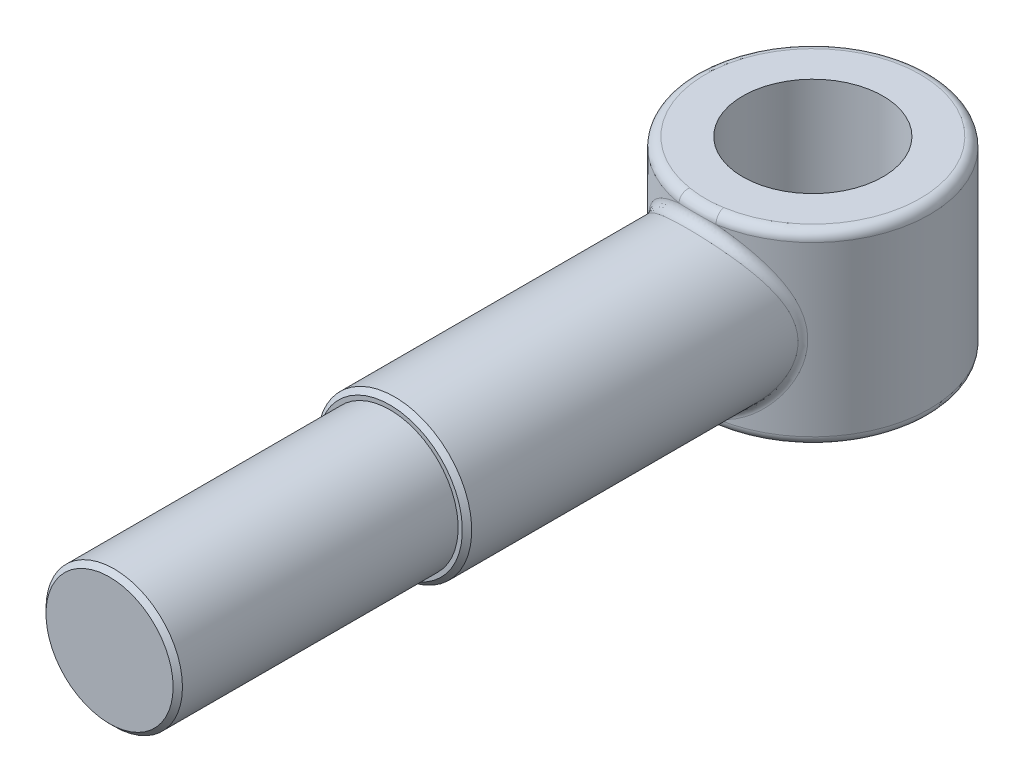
ISO-10303-21;
HEADER;
FILE_DESCRIPTION(('STEP AP214'),'2;1');
FILE_NAME('part.step','',(''),(''),'','','');
FILE_SCHEMA(('AUTOMOTIVE_DESIGN { 1 0 10303 214 1 1 1 1 }'));
ENDSEC;
DATA;
#1=APPLICATION_CONTEXT('core data for automotive mechanical design processes');
#2=APPLICATION_PROTOCOL_DEFINITION('international standard','automotive_design',2000,#1);
#3=PRODUCT_CONTEXT('',#1,'mechanical');
#4=PRODUCT('Part','Part','',(#3));
#5=PRODUCT_RELATED_PRODUCT_CATEGORY('part','',(#4));
#6=PRODUCT_DEFINITION_FORMATION('','',#4);
#7=PRODUCT_DEFINITION_CONTEXT('part definition',#1,'design');
#8=PRODUCT_DEFINITION('design','',#6,#7);
#9=PRODUCT_DEFINITION_SHAPE('','',#8);
#10=(LENGTH_UNIT() NAMED_UNIT(*) SI_UNIT(.MILLI.,.METRE.));
#11=(NAMED_UNIT(*) PLANE_ANGLE_UNIT() SI_UNIT($,.RADIAN.));
#12=(NAMED_UNIT(*) SI_UNIT($,.STERADIAN.) SOLID_ANGLE_UNIT());
#13=UNCERTAINTY_MEASURE_WITH_UNIT(LENGTH_MEASURE(1.E-05),#10,'distance_accuracy_value','');
#14=(GEOMETRIC_REPRESENTATION_CONTEXT(3) GLOBAL_UNCERTAINTY_ASSIGNED_CONTEXT((#13)) GLOBAL_UNIT_ASSIGNED_CONTEXT((#10,
#11,#12)) REPRESENTATION_CONTEXT('',''));
#15=CARTESIAN_POINT('',(0.,0.,0.));
#16=DIRECTION('',(0.,0.,1.));
#17=DIRECTION('',(1.,0.,0.));
#18=AXIS2_PLACEMENT_3D('',#15,#16,#17);
#19=CARTESIAN_POINT('',(0.,0.,-75.));
#20=DIRECTION('',(0.,0.,1.));
#21=DIRECTION('',(1.,0.,0.));
#22=AXIS2_PLACEMENT_3D('',#19,#20,#21);
#23=CYLINDRICAL_SURFACE('',#22,16.5);
#24=CARTESIAN_POINT('',(0.,0.,-1.00000000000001));
#25=DIRECTION('',(0.,0.,-1.));
#26=DIRECTION('',(-1.,0.,0.));
#27=AXIS2_PLACEMENT_3D('',#24,#25,#26);
#28=CIRCLE('',#27,16.5);
#29=CARTESIAN_POINT('',(-16.5,0.,-1.00000000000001));
#30=VERTEX_POINT('',#29);
#31=EDGE_CURVE('E169',#30,#30,#28,.T.);
#32=ORIENTED_EDGE('',*,*,#31,.T.);
#33=EDGE_LOOP('',(#32));
#34=FACE_BOUND('',#33,.T.);
#35=CARTESIAN_POINT('',(16.4643791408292,-1.08361409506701,-70.7965452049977));
#36=CARTESIAN_POINT('',(16.4608732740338,-1.13688206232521,-71.6641526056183));
#37=CARTESIAN_POINT('',(17.0926495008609,-1.21496125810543,-72.2560603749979));
#38=CARTESIAN_POINT('',(16.4883114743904,-0.719979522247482,-70.8216844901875));
#39=CARTESIAN_POINT('',(16.4871418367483,-0.755689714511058,-71.6871481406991));
#40=CARTESIAN_POINT('',(17.1174950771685,-0.807249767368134,-72.2793374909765));
#41=CARTESIAN_POINT('',(16.5002238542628,-0.354851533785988,-70.834275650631));
#42=CARTESIAN_POINT('',(16.5002459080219,-0.372336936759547,-71.6986935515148));
#43=CARTESIAN_POINT('',(17.1298620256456,-0.397863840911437,-72.2909959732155));
#44=CARTESIAN_POINT('',(16.4997697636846,0.375375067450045,-70.8337967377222));
#45=CARTESIAN_POINT('',(16.499747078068,0.393876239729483,-71.6982550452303));
#46=CARTESIAN_POINT('',(17.1293906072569,0.420875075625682,-72.2905525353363));
#47=CARTESIAN_POINT('',(16.4874033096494,0.740473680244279,-70.8207266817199));
#48=CARTESIAN_POINT('',(16.4861435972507,0.777195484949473,-71.6862706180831));
#49=CARTESIAN_POINT('',(17.1165522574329,0.830228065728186,-72.278450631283));
#50=CARTESIAN_POINT('',(16.4386242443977,1.46785364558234,-70.7694954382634));
#51=CARTESIAN_POINT('',(16.4325716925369,1.54013574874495,-71.6393811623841));
#52=CARTESIAN_POINT('',(17.0659118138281,1.64577529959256,-72.2310142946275));
#53=CARTESIAN_POINT('',(16.4021969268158,1.83013313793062,-70.7313189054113));
#54=CARTESIAN_POINT('',(16.3925236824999,1.92020125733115,-71.6044067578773));
#55=CARTESIAN_POINT('',(17.028094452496,2.05196745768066,-72.1956656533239));
#56=CARTESIAN_POINT('',(16.3059633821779,2.54893630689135,-70.6314917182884));
#57=CARTESIAN_POINT('',(16.2869213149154,2.67330647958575,-71.5131541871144));
#58=CARTESIAN_POINT('',(16.9281886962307,2.85789828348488,-72.1032330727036));
#59=CARTESIAN_POINT('',(16.2461566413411,2.90545985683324,-70.5698405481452));
#60=CARTESIAN_POINT('',(16.2212455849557,3.04675914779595,-71.4567729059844));
#61=CARTESIAN_POINT('',(16.8660997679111,3.25763680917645,-72.0461486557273));
#62=CARTESIAN_POINT('',(16.1081963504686,3.5904051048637,-70.4295952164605));
#63=CARTESIAN_POINT('',(16.0700775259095,3.76298341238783,-71.3288564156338));
#64=CARTESIAN_POINT('',(16.722874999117,4.02560572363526,-71.916291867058));
#65=CARTESIAN_POINT('',(16.0312838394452,3.91926978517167,-70.3521680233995));
#66=CARTESIAN_POINT('',(15.9857696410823,4.10667106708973,-71.2582388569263));
#67=CARTESIAN_POINT('',(16.6430275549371,4.39433278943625,-71.8446000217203));
#68=CARTESIAN_POINT('',(15.8584749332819,4.56856182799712,-70.1809713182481));
#69=CARTESIAN_POINT('',(15.7967417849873,4.78403172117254,-71.1025026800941));
#70=CARTESIAN_POINT('',(16.4636243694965,5.12232689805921,-71.6860845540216));
#71=CARTESIAN_POINT('',(15.7625714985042,4.88898601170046,-70.0871957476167));
#72=CARTESIAN_POINT('',(15.6918436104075,5.11795889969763,-71.0172479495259));
#73=CARTESIAN_POINT('',(16.3640613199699,5.48159037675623,-71.5992553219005));
#74=CARTESIAN_POINT('',(15.4477064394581,5.83616951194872,-69.7850786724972));
#75=CARTESIAN_POINT('',(15.3473428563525,6.10545164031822,-70.7426995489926));
#76=CARTESIAN_POINT('',(16.0371812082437,6.54358399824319,-71.3195172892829));
#77=CARTESIAN_POINT('',(15.2015790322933,6.44889344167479,-69.5559350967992));
#78=CARTESIAN_POINT('',(15.0784903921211,6.74100912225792,-70.5351709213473));
#79=CARTESIAN_POINT('',(15.7816617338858,7.23057749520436,-71.1073473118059));
#80=CARTESIAN_POINT('',(14.7137374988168,7.48308990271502,-69.1240545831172));
#81=CARTESIAN_POINT('',(14.5503783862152,7.80569813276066,-70.1480386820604));
#82=CARTESIAN_POINT('',(15.2752044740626,8.39013110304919,-70.7074579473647));
#83=CARTESIAN_POINT('',(14.486275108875,7.91410709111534,-68.9290167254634));
#84=CARTESIAN_POINT('',(14.3039899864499,8.248539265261,-69.9734414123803));
#85=CARTESIAN_POINT('',(15.0390622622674,8.87339279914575,-70.5268673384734));
#86=CARTESIAN_POINT('',(13.9964837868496,8.75119955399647,-68.5262697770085));
#87=CARTESIAN_POINT('',(13.776280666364,9.10439440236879,-69.615257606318));
#88=CARTESIAN_POINT('',(14.5305808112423,9.81195101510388,-70.1539534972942));
#89=CARTESIAN_POINT('',(13.7341416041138,9.15726526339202,-68.3185558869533));
#90=CARTESIAN_POINT('',(13.4942020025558,9.51758630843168,-69.4313356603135));
#91=CARTESIAN_POINT('',(14.2582278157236,10.2672368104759,-69.9616258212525));
#92=CARTESIAN_POINT('',(13.1758165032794,9.94389060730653,-67.8968014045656));
#93=CARTESIAN_POINT('',(12.8974707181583,10.3134456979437,-69.0606243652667));
#94=CARTESIAN_POINT('',(13.6785973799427,11.1492106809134,-69.5711124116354));
#95=CARTESIAN_POINT('',(12.8797773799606,10.3244058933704,-67.6827506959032));
#96=CARTESIAN_POINT('',(12.5820458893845,10.6960407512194,-68.8736141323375));
#97=CARTESIAN_POINT('',(13.3712615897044,11.5758490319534,-69.3729173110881));
#98=CARTESIAN_POINT('',(12.2556473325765,11.0580734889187,-67.25460908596));
#99=CARTESIAN_POINT('',(11.9215626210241,11.4288400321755,-68.5026374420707));
#100=CARTESIAN_POINT('',(12.7233151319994,12.3984460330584,-68.9764898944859));
#101=CARTESIAN_POINT('',(11.9275602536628,11.4112290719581,-67.0405181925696));
#102=CARTESIAN_POINT('',(11.5758464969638,11.778846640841,-68.3185813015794));
#103=CARTESIAN_POINT('',(12.3827084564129,12.7944083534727,-68.7782575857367));
#104=CARTESIAN_POINT('',(11.2370276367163,12.0920023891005,-66.6157009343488));
#105=CARTESIAN_POINT('',(10.8537275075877,12.4484917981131,-67.9566939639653));
#106=CARTESIAN_POINT('',(11.6658255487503,13.5576996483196,-68.3849082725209));
#107=CARTESIAN_POINT('',(10.8742826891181,12.4193426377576,-66.4050265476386));
#108=CARTESIAN_POINT('',(10.4765557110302,12.7673600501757,-67.7790221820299));
#109=CARTESIAN_POINT('',(11.2892384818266,13.9247175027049,-68.189839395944));
#110=CARTESIAN_POINT('',(10.1181828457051,13.0427152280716,-65.994466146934));
#111=CARTESIAN_POINT('',(9.69718585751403,13.3693866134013,-67.4363260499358));
#112=CARTESIAN_POINT('',(10.5042863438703,14.6236504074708,-67.8096908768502));
#113=CARTESIAN_POINT('',(9.72482523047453,13.3387447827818,-65.7945810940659));
#114=CARTESIAN_POINT('',(9.29461020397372,13.6519571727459,-67.2715135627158));
#115=CARTESIAN_POINT('',(10.0959184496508,14.9555623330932,-67.624612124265));
#116=CARTESIAN_POINT('',(8.90964609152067,13.8964618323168,-65.4110979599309));
#117=CARTESIAN_POINT('',(8.46824076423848,14.1793182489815,-66.9588157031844));
#118=CARTESIAN_POINT('',(9.24963258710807,15.5808814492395,-67.269535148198));
#119=CARTESIAN_POINT('',(8.4878766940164,14.15820975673,-65.2274714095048));
#120=CARTESIAN_POINT('',(8.04436202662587,14.4234397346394,-66.8112498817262));
#121=CARTESIAN_POINT('',(8.81176873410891,15.8743563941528,-67.0995105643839));
#122=CARTESIAN_POINT('',(7.61723500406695,14.6450084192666,-64.8811162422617));
#123=CARTESIAN_POINT('',(7.17814941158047,14.8730143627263,-66.5360947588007));
#124=CARTESIAN_POINT('',(7.90790390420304,16.4201609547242,-66.7788113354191));
#125=CARTESIAN_POINT('',(7.16837089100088,14.8700701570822,-64.7183813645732));
#126=CARTESIAN_POINT('',(6.73604485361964,15.0776205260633,-66.4089681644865));
#127=CARTESIAN_POINT('',(7.44191141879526,16.6725029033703,-66.6281308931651));
#128=CARTESIAN_POINT('',(6.34837247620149,15.2349142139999,-64.451743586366));
#129=CARTESIAN_POINT('',(5.93768884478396,15.4056568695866,-66.2032843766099));
#130=CARTESIAN_POINT('',(6.59062237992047,17.0815704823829,-66.3812440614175));
#131=CARTESIAN_POINT('',(5.98201764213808,15.3825469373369,-64.3427907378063));
#132=CARTESIAN_POINT('',(5.58346640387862,15.5369342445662,-66.1202473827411));
#133=CARTESIAN_POINT('',(6.21028767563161,17.2470980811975,-66.2803617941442));
#134=CARTESIAN_POINT('',(5.23627335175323,15.6521102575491,-64.1425274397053));
#135=CARTESIAN_POINT('',(4.86775906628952,15.7748977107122,-65.9688884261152));
#136=CARTESIAN_POINT('',(5.43608625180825,17.5493357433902,-66.0949328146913));
#137=CARTESIAN_POINT('',(4.85688648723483,15.7740459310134,-64.0512135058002));
#138=CARTESIAN_POINT('',(4.5067306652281,15.8811715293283,-65.9008197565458));
#139=CARTESIAN_POINT('',(5.04222222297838,17.6860514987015,-66.0103828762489));
#140=CARTESIAN_POINT('',(4.08733699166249,15.9907280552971,-63.8881442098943));
#141=CARTESIAN_POINT('',(3.77920446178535,16.0688905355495,-65.7801034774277));
#142=CARTESIAN_POINT('',(4.24330720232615,17.9289981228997,-65.8593927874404));
#143=CARTESIAN_POINT('',(3.6971795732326,16.0854874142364,-63.81637956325));
#144=CARTESIAN_POINT('',(3.41331906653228,16.1499723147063,-65.7276852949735));
#145=CARTESIAN_POINT('',(3.83826162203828,18.0352434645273,-65.7929440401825));
#146=CARTESIAN_POINT('',(2.90842656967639,16.2466323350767,-63.6939304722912));
#147=CARTESIAN_POINT('',(2.67737895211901,16.2873040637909,-65.6386684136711));
#148=CARTESIAN_POINT('',(3.01941029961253,18.2159211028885,-65.6795652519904));
#149=CARTESIAN_POINT('',(2.50983080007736,16.3130172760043,-63.6432464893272));
#150=CARTESIAN_POINT('',(2.30807264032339,16.3432494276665,-65.6022653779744));
#151=CARTESIAN_POINT('',(2.60560436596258,18.2903527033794,-65.6326356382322));
#152=CARTESIAN_POINT('',(1.70564498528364,16.4166293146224,-63.5639961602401));
#153=CARTESIAN_POINT('',(1.56524993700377,16.4304475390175,-65.545447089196));
#154=CARTESIAN_POINT('',(1.77073132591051,18.4065237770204,-65.5592557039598));
#155=CARTESIAN_POINT('',(1.30003489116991,16.4537503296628,-63.5355102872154));
#156=CARTESIAN_POINT('',(1.19259088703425,16.461401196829,-65.5252259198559));
#157=CARTESIAN_POINT('',(1.34964340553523,18.4481443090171,-65.5328798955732));
#158=CARTESIAN_POINT('',(0.486407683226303,16.4978599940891,-63.5016500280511));
#159=CARTESIAN_POINT('',(0.445532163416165,16.4982468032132,-65.5011495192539));
#160=CARTESIAN_POINT('',(0.504968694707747,18.4976005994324,-65.5015278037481));
#161=CARTESIAN_POINT('',(0.0783905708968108,16.5048486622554,-63.496275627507));
#162=CARTESIAN_POINT('',(0.0720594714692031,16.5040470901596,-65.4973541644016));
#163=CARTESIAN_POINT('',(0.0813819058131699,18.5054363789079,-65.4965515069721));
#164=CARTESIAN_POINT('',(-0.736763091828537,16.488583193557,-63.5087700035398));
#165=CARTESIAN_POINT('',(-0.67553665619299,16.4904797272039,-65.5062242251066));
#166=CARTESIAN_POINT('',(-0.764877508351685,18.4871993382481,-65.5081203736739));
#167=CARTESIAN_POINT('',(-1.14389961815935,16.4653282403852,-63.5266394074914));
#168=CARTESIAN_POINT('',(-1.04872088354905,16.4711454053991,-65.5188678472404));
#169=CARTESIAN_POINT('',(-1.18755010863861,18.4611256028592,-65.5246661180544));
#170=CARTESIAN_POINT('',(-1.95402461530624,16.3889388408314,-63.5851867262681));
#171=CARTESIAN_POINT('',(-1.79453974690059,16.4071247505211,-65.5606503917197));
#172=CARTESIAN_POINT('',(-2.02858896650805,18.3754768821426,-65.5788765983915));
#173=CARTESIAN_POINT('',(-2.35701320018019,16.3358052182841,-63.6258640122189));
#174=CARTESIAN_POINT('',(-2.16627536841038,16.3625957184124,-65.5896868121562));
#175=CARTESIAN_POINT('',(-2.44695534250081,18.3159028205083,-65.6165407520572));
#176=CARTESIAN_POINT('',(-3.13305713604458,16.2043185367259,-63.7261159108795));
#177=CARTESIAN_POINT('',(-2.88679496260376,16.2512293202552,-65.6620701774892));
#178=CARTESIAN_POINT('',(-3.25261262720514,18.1684783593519,-65.7093665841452));
#179=CARTESIAN_POINT('',(-3.50651132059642,16.1275717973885,-63.7844840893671));
#180=CARTESIAN_POINT('',(-3.23487621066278,16.1860494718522,-65.7043511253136));
#181=CARTESIAN_POINT('',(-3.64031758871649,18.0824289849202,-65.7634111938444));
#182=CARTESIAN_POINT('',(-4.2448606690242,15.9491523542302,-63.919477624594));
#183=CARTESIAN_POINT('',(-3.92799397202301,16.0328371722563,-65.8033138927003));
#184=CARTESIAN_POINT('',(-4.40684188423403,17.8823829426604,-65.8884052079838));
#185=CARTESIAN_POINT('',(-4.60975282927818,15.8474710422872,-63.9961092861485));
#186=CARTESIAN_POINT('',(-4.27244935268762,15.9450872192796,-65.8598155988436));
#187=CARTESIAN_POINT('',(-4.78565810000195,17.7683766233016,-65.959360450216));
#188=CARTESIAN_POINT('',(-5.32875389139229,15.6203869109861,-64.1661232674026));
#189=CARTESIAN_POINT('',(-4.95652388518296,15.746787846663,-65.9867814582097));
#190=CARTESIAN_POINT('',(-5.53209579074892,17.5137671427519,-66.1167808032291));
#191=CARTESIAN_POINT('',(-5.68286572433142,15.494990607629,-64.2595009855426));
#192=CARTESIAN_POINT('',(-5.29568140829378,15.6365818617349,-66.0570312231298));
#193=CARTESIAN_POINT('',(-5.89972030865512,17.3731712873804,-66.2032416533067));
#194=CARTESIAN_POINT('',(-6.37887812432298,15.2216878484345,-64.4613678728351));
#195=CARTESIAN_POINT('',(-5.96766632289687,15.3935080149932,-66.2108662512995));
#196=CARTESIAN_POINT('',(-6.62229210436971,17.0667409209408,-66.3901554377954));
#197=CARTESIAN_POINT('',(-6.72077414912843,15.0737731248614,-64.5698625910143));
#198=CARTESIAN_POINT('',(-6.30015748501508,15.2609918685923,-66.2942382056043));
#199=CARTESIAN_POINT('',(-6.97723466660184,16.9008971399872,-66.4906135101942));
#200=CARTESIAN_POINT('',(-7.41686901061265,14.7444740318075,-64.8090438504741));
#201=CARTESIAN_POINT('',(-6.98215988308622,14.9626499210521,-66.4802784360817));
#202=CARTESIAN_POINT('',(-7.69989207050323,16.5316830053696,-66.7120776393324));
#203=CARTESIAN_POINT('',(-7.76997086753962,14.5613849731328,-64.9407982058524));
#204=CARTESIAN_POINT('',(-7.33104372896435,14.7953450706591,-66.5837690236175));
#205=CARTESIAN_POINT('',(-8.06646807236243,16.3264013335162,-66.834072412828));
#206=CARTESIAN_POINT('',(-8.45907553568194,14.1721851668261,-65.2173078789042));
#207=CARTESIAN_POINT('',(-8.01725276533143,14.4355151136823,-66.8036970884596));
#208=CARTESIAN_POINT('',(-8.78186854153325,15.8900257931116,-67.0900998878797));
#209=CARTESIAN_POINT('',(-8.79507106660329,13.9660647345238,-65.362068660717));
#210=CARTESIAN_POINT('',(-8.35447213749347,14.2434056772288,-66.9199089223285));
#211=CARTESIAN_POINT('',(-9.13068545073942,15.6589210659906,-67.2241376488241));
#212=CARTESIAN_POINT('',(-9.77605983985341,13.3151854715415,-65.812311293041));
#213=CARTESIAN_POINT('',(-9.3401410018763,13.6338153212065,-67.2834402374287));
#214=CARTESIAN_POINT('',(-10.14910813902,14.9291473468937,-67.6410289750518));
#215=CARTESIAN_POINT('',(-10.394184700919,12.8378467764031,-66.1337993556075));
#216=CARTESIAN_POINT('',(-9.97511845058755,13.1777631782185,-67.5490652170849));
#217=CARTESIAN_POINT('',(-10.7908202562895,14.3939494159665,-67.9387031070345));
#218=CARTESIAN_POINT('',(-11.3109660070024,12.0215455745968,-66.6599186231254));
#219=CARTESIAN_POINT('',(-10.9309671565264,12.3789727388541,-67.9943938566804));
#220=CARTESIAN_POINT('',(-11.7425853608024,13.4787026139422,-68.4258505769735));
#221=CARTESIAN_POINT('',(-11.635680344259,11.7074530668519,-66.8576268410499));
#222=CARTESIAN_POINT('',(-11.2704376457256,12.0707627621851,-68.1624832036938));
#223=CARTESIAN_POINT('',(-12.0796905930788,13.1265382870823,-68.6089137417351));
#224=CARTESIAN_POINT('',(-12.2577592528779,11.0544349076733,-67.2561643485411));
#225=CARTESIAN_POINT('',(-11.9239011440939,11.4247056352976,-68.5041734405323));
#226=CARTESIAN_POINT('',(-12.7255076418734,12.3943664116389,-68.9779299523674));
#227=CARTESIAN_POINT('',(-12.5551196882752,10.7155055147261,-67.4569941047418));
#228=CARTESIAN_POINT('',(-12.2383742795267,11.0871200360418,-68.6777724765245));
#229=CARTESIAN_POINT('',(-13.0342151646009,12.0143546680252,-69.1638834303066));
#230=CARTESIAN_POINT('',(-13.121580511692,10.0138713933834,-67.8572105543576));
#231=CARTESIAN_POINT('',(-12.8396830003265,10.3835068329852,-69.0260987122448));
#232=CARTESIAN_POINT('',(-13.6222917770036,11.2276739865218,-69.5344542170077));
#233=CARTESIAN_POINT('',(-13.3906659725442,9.6511542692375,-68.0565964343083));
#234=CARTESIAN_POINT('',(-13.1270681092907,10.0175814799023,-69.2009341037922));
#235=CARTESIAN_POINT('',(-13.9016453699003,10.8209911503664,-69.7190707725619));
#236=CARTESIAN_POINT('',(-13.8993517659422,8.90295395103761,-68.4488129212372));
#237=CARTESIAN_POINT('',(-13.6718316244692,9.25862831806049,-69.5466861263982));
#238=CARTESIAN_POINT('',(-14.4297422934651,9.98209988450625,-70.0822341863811));
#239=CARTESIAN_POINT('',(-14.1389563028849,8.51747401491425,-68.6416444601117));
#240=CARTESIAN_POINT('',(-13.9298155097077,8.86557678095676,-69.7178070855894));
#241=CARTESIAN_POINT('',(-14.6784899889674,9.54989510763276,-70.2607819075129));
#242=CARTESIAN_POINT('',(-14.5585540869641,7.77535595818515,-68.9912384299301));
#243=CARTESIAN_POINT('',(-14.3827378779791,8.1051208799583,-70.0294723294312));
#244=CARTESIAN_POINT('',(-15.1140993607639,8.71782334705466,-70.5844800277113));
#245=CARTESIAN_POINT('',(-14.7422515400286,7.42135590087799,-69.1494556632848));
#246=CARTESIAN_POINT('',(-14.581687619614,7.74121026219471,-70.1711436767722));
#247=CARTESIAN_POINT('',(-15.3048065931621,8.32091419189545,-70.7309774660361));
#248=CARTESIAN_POINT('',(-15.0850196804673,6.697209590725,-69.4525968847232));
#249=CARTESIAN_POINT('',(-14.9533400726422,6.99459798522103,-70.443285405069));
#250=CARTESIAN_POINT('',(-15.6606545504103,7.50899257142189,-71.0116637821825));
#251=CARTESIAN_POINT('',(-15.2440910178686,6.32706376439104,-69.5975212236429));
#252=CARTESIAN_POINT('',(-15.1264431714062,6.6116790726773,-70.5739831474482));
#253=CARTESIAN_POINT('',(-15.825795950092,7.0939805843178,-71.1458529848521));
#254=CARTESIAN_POINT('',(-15.5359422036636,5.5720771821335,-69.8694246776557));
#255=CARTESIAN_POINT('',(-15.4442235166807,5.8289005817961,-70.8196192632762));
#256=CARTESIAN_POINT('',(-16.1287839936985,6.24748047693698,-71.3976154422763));
#257=CARTESIAN_POINT('',(-15.6687594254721,5.18725825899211,-69.9964292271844));
#258=CARTESIAN_POINT('',(-15.5893168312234,5.42875074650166,-70.9348267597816));
#259=CARTESIAN_POINT('',(-16.2666694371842,5.81601683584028,-71.5152122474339));
#260=CARTESIAN_POINT('',(-15.9067007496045,4.40389989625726,-70.2280566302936));
#261=CARTESIAN_POINT('',(-15.8492598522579,4.61293133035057,-71.1451271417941));
#262=CARTESIAN_POINT('',(-16.5136904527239,4.93770594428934,-71.7296820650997));
#263=CARTESIAN_POINT('',(-16.0118289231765,4.00536248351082,-70.3326827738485));
#264=CARTESIAN_POINT('',(-15.9644528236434,4.19683860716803,-71.2404719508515));
#265=CARTESIAN_POINT('',(-16.6228302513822,4.49086096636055,-71.8265581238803));
#266=CARTESIAN_POINT('',(-16.1825875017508,3.2418213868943,-70.5048543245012));
#267=CARTESIAN_POINT('',(-16.1515188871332,3.39876730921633,-71.3974278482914));
#268=CARTESIAN_POINT('',(-16.8001048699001,3.63476943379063,-71.9859762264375));
#269=CARTESIAN_POINT('',(-16.251310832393,2.87801933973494,-70.575229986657));
#270=CARTESIAN_POINT('',(-16.226955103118,3.01792065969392,-71.4617452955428));
#271=CARTESIAN_POINT('',(-16.8714506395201,3.22687016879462,-72.0511388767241));
#272=CARTESIAN_POINT('',(-16.3643797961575,2.1436063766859,-70.6919074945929));
#273=CARTESIAN_POINT('',(-16.3509878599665,2.2488271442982,-71.5683430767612));
#274=CARTESIAN_POINT('',(-16.9888342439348,2.40343745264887,-72.1591736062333));
#275=CARTESIAN_POINT('',(-16.4087283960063,1.77299629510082,-70.7382122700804));
#276=CARTESIAN_POINT('',(-16.3997351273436,1.86014874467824,-71.6107499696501));
#277=CARTESIAN_POINT('',(-17.0348751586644,1.98790493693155,-72.2020483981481));
#278=CARTESIAN_POINT('',(-16.4721781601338,1.02807210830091,-70.8046804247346));
#279=CARTESIAN_POINT('',(-16.4694073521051,1.07898598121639,-71.6715691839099));
#280=CARTESIAN_POINT('',(-17.1007461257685,1.15268690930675,-72.2635929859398));
#281=CARTESIAN_POINT('',(-16.4913016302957,0.653761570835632,-70.8248668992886));
#282=CARTESIAN_POINT('',(-16.4904431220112,0.686030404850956,-71.6900775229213));
#283=CARTESIAN_POINT('',(-17.1205993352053,0.733005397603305,-72.2822841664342));
#284=CARTESIAN_POINT('',(-16.5039793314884,-0.0956986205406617,-70.8382355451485));
#285=CARTESIAN_POINT('',(-16.5043705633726,-0.100345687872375,-71.70231848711));
#286=CARTESIAN_POINT('',(-17.1337608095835,-0.107298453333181,-72.2946625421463));
#287=CARTESIAN_POINT('',(-16.4975316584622,-0.470848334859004,-70.8314157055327));
#288=CARTESIAN_POINT('',(-16.4972777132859,-0.494261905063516,-71.6960647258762));
#289=CARTESIAN_POINT('',(-17.1270670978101,-0.52792086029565,-72.2883478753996));
#290=CARTESIAN_POINT('',(-16.4571268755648,-1.25891740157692,-70.7889016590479));
#291=CARTESIAN_POINT('',(-16.452893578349,-1.32102715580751,-71.6571430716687));
#292=CARTESIAN_POINT('',(-17.0851204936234,-1.41151345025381,-72.2489830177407));
#293=CARTESIAN_POINT('',(-16.4202873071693,-1.67156215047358,-70.7501825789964));
#294=CARTESIAN_POINT('',(-16.4123712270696,-1.75409530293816,-71.6216495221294));
#295=CARTESIAN_POINT('',(-17.0468751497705,-1.8741757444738,-72.2131320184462));
#296=CARTESIAN_POINT('',(-16.3162875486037,-2.48976777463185,-70.6421278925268));
#297=CARTESIAN_POINT('',(-16.2982354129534,-2.61147095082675,-71.5228614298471));
#298=CARTESIAN_POINT('',(-16.9389068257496,-2.7915578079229,-72.113081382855));
#299=CARTESIAN_POINT('',(-16.249122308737,-2.89532745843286,-70.5727871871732));
#300=CARTESIAN_POINT('',(-16.2244468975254,-3.03638990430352,-71.4594176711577));
#301=CARTESIAN_POINT('',(-16.8691786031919,-3.24627624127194,-72.0488770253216));
#302=CARTESIAN_POINT('',(-16.0857678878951,-3.69670383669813,-70.4068699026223));
#303=CARTESIAN_POINT('',(-16.0454457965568,-3.87438352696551,-71.3080837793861));
#304=CARTESIAN_POINT('',(-16.6995906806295,-4.14478915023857,-71.895249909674));
#305=CARTESIAN_POINT('',(-15.9895291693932,-4.09250264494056,-70.3102468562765));
#306=CARTESIAN_POINT('',(-15.9399291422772,-4.28796669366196,-71.2199487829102));
#307=CARTESIAN_POINT('',(-16.5996795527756,-4.58856357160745,-71.8057841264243));
#308=CARTESIAN_POINT('',(-15.7696819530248,-4.8714534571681,-70.0940332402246));
#309=CARTESIAN_POINT('',(-15.6995731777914,-5.10001030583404,-71.0234202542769));
#310=CARTESIAN_POINT('',(-16.3714431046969,-5.46193266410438,-71.6055863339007));
#311=CARTESIAN_POINT('',(-15.6460584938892,-5.25459841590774,-69.9744301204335));
#312=CARTESIAN_POINT('',(-15.5644064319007,-5.49889645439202,-70.9147811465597));
#313=CARTESIAN_POINT('',(-16.2431022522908,-5.89151943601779,-71.4948427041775));
#314=CARTESIAN_POINT('',(-15.3747069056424,-6.0020501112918,-69.7182834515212));
#315=CARTESIAN_POINT('',(-15.2686604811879,-6.27487778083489,-70.6830390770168));
#316=CARTESIAN_POINT('',(-15.9613960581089,-6.72957133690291,-71.2576698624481));
#317=CARTESIAN_POINT('',(-15.2272791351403,-6.3665253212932,-69.5819555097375));
#318=CARTESIAN_POINT('',(-15.1080449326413,-6.65252822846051,-70.5598793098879));
#319=CARTESIAN_POINT('',(-15.808342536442,-7.13822536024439,-71.1314402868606));
#320=CARTESIAN_POINT('',(-14.9087843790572,-7.08032099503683,-69.2954982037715));
#321=CARTESIAN_POINT('',(-14.7622283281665,-7.38984237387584,-70.302173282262));
#322=CARTESIAN_POINT('',(-15.4776942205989,-7.93854172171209,-70.866202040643));
#323=CARTESIAN_POINT('',(-14.737719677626,-7.4296429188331,-69.1453701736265));
#324=CARTESIAN_POINT('',(-14.576666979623,-7.74973569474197,-70.167411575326));
#325=CARTESIAN_POINT('',(-15.3001017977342,-8.33020569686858,-70.7271946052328));
#326=CARTESIAN_POINT('',(-14.1907337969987,-8.45412923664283,-68.6801023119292));
#327=CARTESIAN_POINT('',(-13.9829765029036,-8.80589341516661,-69.7500100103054));
#328=CARTESIAN_POINT('',(-14.7322432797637,-9.47887217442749,-70.296391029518));
#329=CARTESIAN_POINT('',(-13.7808647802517,-9.10623815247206,-68.3499249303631));
#330=CARTESIAN_POINT('',(-13.5405268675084,-9.47074502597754,-69.4565914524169));
#331=CARTESIAN_POINT('',(-14.3067339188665,-10.2100245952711,-69.9906712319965));
#332=CARTESIAN_POINT('',(-13.0619453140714,-10.0916844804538,-67.8141344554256));
#333=CARTESIAN_POINT('',(-12.7764099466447,-10.461906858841,-68.9884855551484));
#334=CARTESIAN_POINT('',(-13.5603809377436,-11.3149189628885,-69.4945689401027));
#335=CARTESIAN_POINT('',(-12.7796321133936,-10.446853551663,-67.6124404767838));
#336=CARTESIAN_POINT('',(-12.4760363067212,-10.818427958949,-68.8126168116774));
#337=CARTESIAN_POINT('',(-13.2672948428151,-11.7131388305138,-69.3078152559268));
#338=CARTESIAN_POINT('',(-12.1865394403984,-11.1330046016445,-67.2093505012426));
#339=CARTESIAN_POINT('',(-11.849025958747,-11.5028682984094,-68.4638582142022));
#340=CARTESIAN_POINT('',(-12.6515701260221,-12.4824597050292,-68.9345837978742));
#341=CARTESIAN_POINT('',(-11.875756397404,-11.4639835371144,-67.0079545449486));
#342=CARTESIAN_POINT('',(-11.5218397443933,-11.8306029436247,-68.2909036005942));
#343=CARTESIAN_POINT('',(-12.3289277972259,-12.8535572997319,-68.7481060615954));
#344=CARTESIAN_POINT('',(-11.226742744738,-12.1002803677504,-66.6101412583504));
#345=CARTESIAN_POINT('',(-10.8434707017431,-12.456124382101,-67.9522413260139));
#346=CARTESIAN_POINT('',(-11.6551481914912,-13.566981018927,-68.3797604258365));
#347=CARTESIAN_POINT('',(-10.8885163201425,-12.4056021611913,-66.4137231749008));
#348=CARTESIAN_POINT('',(-10.4918400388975,-12.7535861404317,-67.7865825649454));
#349=CARTESIAN_POINT('',(-11.3040152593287,-13.9093115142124,-68.1978918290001));
#350=CARTESIAN_POINT('',(-10.1853110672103,-12.9891571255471,-66.0300546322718));
#351=CARTESIAN_POINT('',(-9.76659463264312,-13.317550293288,-67.4660866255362));
#352=CARTESIAN_POINT('',(-10.5739761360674,-14.5636004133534,-67.842643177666));
#353=CARTESIAN_POINT('',(-9.82032392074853,-13.2673818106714,-65.8428070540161));
#354=CARTESIAN_POINT('',(-9.39266286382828,-13.583572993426,-67.3114197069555));
#355=CARTESIAN_POINT('',(-10.1950613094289,-14.8755493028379,-67.669265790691));
#356=CARTESIAN_POINT('',(-9.09850083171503,-13.7711047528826,-65.4978325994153));
#357=CARTESIAN_POINT('',(-8.66006825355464,-14.0606694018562,-67.0295854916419));
#358=CARTESIAN_POINT('',(-9.44569390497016,-15.4403295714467,-67.3498449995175));
#359=CARTESIAN_POINT('',(-8.74383688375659,-13.9990922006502,-65.3389619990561));
#360=CARTESIAN_POINT('',(-8.30248634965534,-14.274340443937,-66.9012477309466));
#361=CARTESIAN_POINT('',(-9.07749620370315,-15.6959518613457,-67.2027425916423));
#362=CARTESIAN_POINT('',(-8.01461237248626,-14.4289639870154,-65.0355078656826));
#363=CARTESIAN_POINT('',(-7.57341653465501,-14.6737819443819,-66.6585357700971));
#364=CARTESIAN_POINT('',(-8.32044494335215,-16.1779293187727,-66.9217665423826));
#365=CARTESIAN_POINT('',(-7.64006230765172,-14.630861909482,-64.8909169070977));
#366=CARTESIAN_POINT('',(-7.20201601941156,-14.8590533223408,-66.5444268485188));
#367=CARTESIAN_POINT('',(-7.93160228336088,-16.4042997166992,-66.7878860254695));
#368=CARTESIAN_POINT('',(-6.87249279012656,-15.0067112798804,-64.6189547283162));
#369=CARTESIAN_POINT('',(-6.44742715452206,-15.2009871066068,-66.3319267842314));
#370=CARTESIAN_POINT('',(-7.13474279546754,-16.8257065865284,-66.5360691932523));
#371=CARTESIAN_POINT('',(-6.47947769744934,-15.180669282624,-64.4915794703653));
#372=CARTESIAN_POINT('',(-6.06452531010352,-15.3571025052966,-66.2338502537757));
#373=CARTESIAN_POINT('',(-6.72673049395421,-17.0207504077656,-66.4181291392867));
#374=CARTESIAN_POINT('',(-5.67688903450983,-15.4986844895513,-64.2568486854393));
#375=CARTESIAN_POINT('',(-5.28910517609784,-15.6401912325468,-66.0547973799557));
#376=CARTESIAN_POINT('',(-5.89351555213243,-17.3773129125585,-66.2007858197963));
#377=CARTESIAN_POINT('',(-5.2673155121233,-15.6427417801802,-64.149493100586));
#378=CARTESIAN_POINT('',(-4.89709457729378,-15.7666085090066,-65.9741576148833));
#379=CARTESIAN_POINT('',(-5.46831296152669,-17.5388316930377,-66.1013825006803));
#380=CARTESIAN_POINT('',(-4.43116096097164,-15.8999208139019,-63.9566976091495));
#381=CARTESIAN_POINT('',(-4.10276053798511,-15.9907636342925,-65.8304795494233));
#382=CARTESIAN_POINT('',(-4.60025127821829,-17.8271839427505,-65.9228681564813));
#383=CARTESIAN_POINT('',(-4.0044785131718,-16.0128117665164,-63.8714214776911));
#384=CARTESIAN_POINT('',(-3.70115791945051,-16.0877576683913,-65.7679046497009));
#385=CARTESIAN_POINT('',(-4.15728689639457,-17.9537586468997,-65.8439087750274));
#386=CARTESIAN_POINT('',(-3.14013363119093,-16.2044897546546,-63.7260516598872));
#387=CARTESIAN_POINT('',(-2.89244322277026,-16.2516797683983,-65.6618179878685));
#388=CARTESIAN_POINT('',(-3.25995915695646,-18.1686703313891,-65.7093070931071));
#389=CARTESIAN_POINT('',(-2.70247109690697,-16.2832764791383,-63.6659582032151));
#390=CARTESIAN_POINT('',(-2.48629279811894,-16.3181762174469,-65.6185825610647));
#391=CARTESIAN_POINT('',(-2.80559569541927,-18.2570069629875,-65.653665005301));
#392=CARTESIAN_POINT('',(-1.82020755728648,-16.405335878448,-63.5726601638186));
#393=CARTESIAN_POINT('',(-1.67048134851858,-16.4210365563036,-65.5515938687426));
#394=CARTESIAN_POINT('',(-1.88966553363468,-18.3938614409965,-65.5672779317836));
#395=CARTESIAN_POINT('',(-1.37561069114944,-16.4486289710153,-63.5394401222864));
#396=CARTESIAN_POINT('',(-1.26194670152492,-16.4571239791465,-65.5280200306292));
#397=CARTESIAN_POINT('',(-1.42810313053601,-18.4424021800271,-65.5365186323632));
#398=CARTESIAN_POINT('',(-0.483434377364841,-16.4989650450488,-63.5008031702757));
#399=CARTESIAN_POINT('',(-0.44267052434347,-16.4991791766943,-65.5005409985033));
#400=CARTESIAN_POINT('',(-0.501881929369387,-18.4988395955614,-65.5007436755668));
#401=CARTESIAN_POINT('',(-0.0358552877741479,-16.5060123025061,-63.4953829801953));
#402=CARTESIAN_POINT('',(-0.0331512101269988,-16.5050247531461,-65.496715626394));
#403=CARTESIAN_POINT('',(-0.037223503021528,-18.5067410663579,-65.4957249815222));
#404=CARTESIAN_POINT('',(0.803500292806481,-16.485102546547,-63.5114425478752));
#405=CARTESIAN_POINT('',(0.736762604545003,-16.4875729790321,-65.5081239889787));
#406=CARTESIAN_POINT('',(0.834161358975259,-18.4832967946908,-65.5105949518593));
#407=CARTESIAN_POINT('',(1.19543813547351,-16.4613016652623,-63.5297284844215));
#408=CARTESIAN_POINT('',(1.09613499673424,-16.4677755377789,-65.5210688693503));
#409=CARTESIAN_POINT('',(1.24105530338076,-18.4566109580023,-65.5275263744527));
#410=CARTESIAN_POINT('',(1.97536245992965,-16.386012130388,-63.5874265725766));
#411=CARTESIAN_POINT('',(1.81428284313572,-16.4046637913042,-65.5622546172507));
#412=CARTESIAN_POINT('',(2.05074104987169,-18.3721954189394,-65.5809505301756));
#413=CARTESIAN_POINT('',(2.36334931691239,-16.3345261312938,-63.6268366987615));
#414=CARTESIAN_POINT('',(2.17225749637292,-16.3614947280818,-65.5904008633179));
#415=CARTESIAN_POINT('',(2.45353324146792,-18.3144686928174,-65.6174413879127));
#416=CARTESIAN_POINT('',(3.13268634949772,-16.2045825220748,-63.7259171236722));
#417=CARTESIAN_POINT('',(2.88639142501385,-16.2514633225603,-65.6619195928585));
#418=CARTESIAN_POINT('',(3.25222769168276,-18.1687743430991,-65.7091825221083));
#419=CARTESIAN_POINT('',(3.51403621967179,-16.1261236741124,-63.7855883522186));
#420=CARTESIAN_POINT('',(3.24182614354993,-16.1848359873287,-65.7051402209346));
#421=CARTESIAN_POINT('',(3.6481296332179,-18.0808053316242,-65.7644336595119));
#422=CARTESIAN_POINT('',(4.26765184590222,-15.9432594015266,-63.9239273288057));
#423=CARTESIAN_POINT('',(3.94939499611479,-16.0277728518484,-65.8065795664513));
#424=CARTESIAN_POINT('',(4.43050275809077,-17.8757756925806,-65.8925253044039));
#425=CARTESIAN_POINT('',(4.6399172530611,-15.8388529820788,-64.0025958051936));
#426=CARTESIAN_POINT('',(4.30091269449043,-15.9376461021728,-65.864601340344));
#427=CARTESIAN_POINT('',(4.81697357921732,-17.7587139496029,-65.9653664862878));
#428=CARTESIAN_POINT('',(5.37368848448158,-15.6051877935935,-64.177464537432));
#429=CARTESIAN_POINT('',(4.99938608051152,-15.7334735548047,-65.9952826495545));
#430=CARTESIAN_POINT('',(5.57874505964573,-17.4967257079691,-66.1272819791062));
#431=CARTESIAN_POINT('',(5.73518114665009,-15.475899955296,-64.2736852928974));
#432=CARTESIAN_POINT('',(5.34585034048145,-15.6197598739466,-66.0677346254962));
#433=CARTESIAN_POINT('',(5.95403205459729,-17.3517666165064,-66.2163752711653));
#434=CARTESIAN_POINT('',(6.44527133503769,-15.1938991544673,-64.4817946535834));
#435=CARTESIAN_POINT('',(6.03199189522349,-15.3686877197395,-66.2265078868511));
#436=CARTESIAN_POINT('',(6.6912188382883,-17.0355839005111,-66.4090691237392));
#437=CARTESIAN_POINT('',(6.79386426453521,-15.0411779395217,-64.5936887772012));
#438=CARTESIAN_POINT('',(6.37131883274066,-15.2317058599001,-66.3126013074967));
#439=CARTESIAN_POINT('',(7.05311385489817,-16.8643510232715,-66.512674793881));
#440=CARTESIAN_POINT('',(7.81780553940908,-14.550066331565,-64.9498854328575));
#441=CARTESIAN_POINT('',(7.37085106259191,-14.7882797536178,-66.5887708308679));
#442=CARTESIAN_POINT('',(8.11612808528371,-16.3137107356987,-66.8424865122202));
#443=CARTESIAN_POINT('',(8.47185443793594,-14.1785540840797,-65.2148349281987));
#444=CARTESIAN_POINT('',(8.02269281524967,-14.4467224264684,-66.7984817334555));
#445=CARTESIAN_POINT('',(8.79513507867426,-15.8971667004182,-67.0878101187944));
#446=CARTESIAN_POINT('',(9.7995551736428,-13.3017328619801,-65.8218853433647));
#447=CARTESIAN_POINT('',(9.36216484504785,-13.6221789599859,-67.2905717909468));
#448=CARTESIAN_POINT('',(10.1735000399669,-14.9140641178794,-67.6498938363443));
#449=CARTESIAN_POINT('',(10.4636403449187,-12.7850713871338,-66.1695824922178));
#450=CARTESIAN_POINT('',(10.0451998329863,-13.1283494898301,-67.5780783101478));
#451=CARTESIAN_POINT('',(10.8629262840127,-14.3347770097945,-67.9718356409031));
#452=CARTESIAN_POINT('',(11.3914748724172,-11.9440005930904,-66.7087626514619));
#453=CARTESIAN_POINT('',(11.0154271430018,-12.3025914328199,-68.0360630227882));
#454=CARTESIAN_POINT('',(11.8261663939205,-13.3917582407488,-68.4710765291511));
#455=CARTESIAN_POINT('',(11.6896815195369,-11.6522480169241,-66.8916541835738));
#456=CARTESIAN_POINT('',(11.3273991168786,-12.0159544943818,-68.1917520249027));
#457=CARTESIAN_POINT('',(12.1357524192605,-13.0646417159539,-68.6404205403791));
#458=CARTESIAN_POINT('',(12.2626078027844,-11.0477043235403,-67.2598997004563));
#459=CARTESIAN_POINT('',(11.9294410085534,-11.4175804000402,-68.5076328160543));
#460=CARTESIAN_POINT('',(12.7305412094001,-12.386819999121,-68.9813886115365));
#461=CARTESIAN_POINT('',(12.5373326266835,-10.7349178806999,-67.4452531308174));
#462=CARTESIAN_POINT('',(12.2198981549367,-11.1060557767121,-68.6678239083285));
#463=CARTESIAN_POINT('',(13.015749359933,-12.0361200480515,-69.1530121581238));
#464=CARTESIAN_POINT('',(13.1058320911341,-10.0360429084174,-67.8452433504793));
#465=CARTESIAN_POINT('',(12.8225202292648,-10.4062843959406,-69.0153990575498));
#466=CARTESIAN_POINT('',(13.6059424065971,-11.2525329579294,-69.5233734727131));
#467=CARTESIAN_POINT('',(13.3953079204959,-9.64635959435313,-68.059682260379));
#468=CARTESIAN_POINT('',(13.1317314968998,-10.013189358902,-69.2034373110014));
#469=CARTESIAN_POINT('',(13.9064644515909,-10.8156153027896,-69.7219280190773));
#470=CARTESIAN_POINT('',(13.940251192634,-8.84058736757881,-68.4808841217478));
#471=CARTESIAN_POINT('',(13.7154620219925,-9.19558480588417,-69.5748675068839));
#472=CARTESIAN_POINT('',(14.4722024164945,-9.91217371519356,-70.1119297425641));
#473=CARTESIAN_POINT('',(14.1957103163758,-8.42449203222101,-68.6876451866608));
#474=CARTESIAN_POINT('',(13.9907228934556,-8.77102504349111,-69.7585160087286));
#475=CARTESIAN_POINT('',(14.7374096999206,-9.44564258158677,-70.3033751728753));
#476=CARTESIAN_POINT('',(14.6703958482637,-7.56762838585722,-69.0861480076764));
#477=CARTESIAN_POINT('',(14.5031130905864,-7.89278692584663,-70.1139037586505));
#478=CARTESIAN_POINT('',(15.2302089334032,-8.48491667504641,-70.6723592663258));
#479=CARTESIAN_POINT('',(14.8896808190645,-7.1269015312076,-69.2779137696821));
#480=CARTESIAN_POINT('',(14.7410594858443,-7.4389161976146,-70.28602381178));
#481=CARTESIAN_POINT('',(15.4578616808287,-7.99076838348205,-70.8499201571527));
#482=CARTESIAN_POINT('',(15.2902209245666,-6.22126428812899,-69.6390147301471));
#483=CARTESIAN_POINT('',(15.1760420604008,-6.50320395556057,-70.610964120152));
#484=CARTESIAN_POINT('',(15.8736861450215,-6.97535692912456,-71.184272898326));
#485=CARTESIAN_POINT('',(15.4714755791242,-5.75635359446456,-69.8083496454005));
#486=CARTESIAN_POINT('',(15.373813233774,-6.02089108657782,-70.7642256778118));
#487=CARTESIAN_POINT('',(16.0618573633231,-6.45409342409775,-71.3410644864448));
#488=CARTESIAN_POINT('',(15.7445670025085,-4.94792068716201,-70.069652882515));
#489=CARTESIAN_POINT('',(15.6721288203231,-5.17942880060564,-71.0012884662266));
#490=CARTESIAN_POINT('',(16.3453697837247,-5.54766864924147,-71.5830119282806));
#491=CARTESIAN_POINT('',(15.8468995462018,-4.60995900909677,-70.1695701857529));
#492=CARTESIAN_POINT('',(15.7840595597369,-4.82727642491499,-71.0921179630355));
#493=CARTESIAN_POINT('',(16.4516072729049,-5.16874191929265,-71.6755279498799));
#494=CARTESIAN_POINT('',(16.0303612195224,-3.92469073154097,-70.3511921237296));
#495=CARTESIAN_POINT('',(15.9847304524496,-4.11243812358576,-71.2573233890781));
#496=CARTESIAN_POINT('',(16.6420697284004,-4.40041082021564,-71.8436964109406));
#497=CARTESIAN_POINT('',(16.1115039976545,-3.57739030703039,-70.4329084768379));
#498=CARTESIAN_POINT('',(16.0736870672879,-3.74945707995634,-71.3318640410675));
#499=CARTESIAN_POINT('',(16.7263088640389,-4.01101337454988,-71.9193597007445));
#500=CARTESIAN_POINT('',(16.251460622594,-2.87540143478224,-70.5752864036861));
#501=CARTESIAN_POINT('',(16.2270661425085,-3.0152859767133,-71.4617494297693));
#502=CARTESIAN_POINT('',(16.871606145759,-3.22393494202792,-72.0511911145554));
#503=CARTESIAN_POINT('',(16.3103041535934,-2.52072347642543,-70.6359759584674));
#504=CARTESIAN_POINT('',(16.2916855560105,-2.64375011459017,-71.5172534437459));
#505=CARTESIAN_POINT('',(16.9326951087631,-2.82626571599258,-72.1073851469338));
#506=CARTESIAN_POINT('',(16.4048577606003,-1.80572783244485,-70.7340992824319));
#507=CARTESIAN_POINT('',(16.3954471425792,-1.89460739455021,-71.6069519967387));
#508=CARTESIAN_POINT('',(17.0308568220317,-2.02460393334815,-72.198240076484));
#509=CARTESIAN_POINT('',(16.4405678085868,-1.44541013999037,-70.771533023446));
#510=CARTESIAN_POINT('',(16.4347067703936,-1.51659339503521,-71.6412464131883));
#511=CARTESIAN_POINT('',(17.067929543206,-1.62061136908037,-72.2329009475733));
#512=CARTESIAN_POINT('',(16.4643791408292,-1.08361409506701,-70.7965452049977));
#513=CARTESIAN_POINT('',(16.4608732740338,-1.13688206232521,-71.6641526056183));
#514=CARTESIAN_POINT('',(17.0926495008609,-1.21496125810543,-72.2560603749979));
#515=(BOUNDED_SURFACE() B_SPLINE_SURFACE(3,2,((#35,#36,#37),(#38,#39,#40),(#41,#42,#43),(#44,
#45,#46),(#47,#48,#49),(#50,#51,#52),(#53,#54,#55),(#56,#57,#58),(#59,#60,#61),(#62,#63,#64),
(#65,#66,#67),(#68,#69,#70),(#71,#72,#73),(#74,#75,#76),(#77,#78,#79),(#80,#81,#82),(#83,#84,
#85),(#86,#87,#88),(#89,#90,#91),(#92,#93,#94),(#95,#96,#97),(#98,#99,#100),(#101,#102,#103),
(#104,#105,#106),(#107,#108,#109),(#110,#111,#112),(#113,#114,#115),(#116,#117,#118),(#119,#120,
#121),(#122,#123,#124),(#125,#126,#127),(#128,#129,#130),(#131,#132,#133),(#134,#135,#136),
(#137,#138,#139),(#140,#141,#142),(#143,#144,#145),(#146,#147,#148),(#149,#150,#151),(#152,#153,
#154),(#155,#156,#157),(#158,#159,#160),(#161,#162,#163),(#164,#165,#166),(#167,#168,#169),
(#170,#171,#172),(#173,#174,#175),(#176,#177,#178),(#179,#180,#181),(#182,#183,#184),(#185,#186,
#187),(#188,#189,#190),(#191,#192,#193),(#194,#195,#196),(#197,#198,#199),(#200,#201,#202),
(#203,#204,#205),(#206,#207,#208),(#209,#210,#211),(#212,#213,#214),(#215,#216,#217),(#218,#219,
#220),(#221,#222,#223),(#224,#225,#226),(#227,#228,#229),(#230,#231,#232),(#233,#234,#235),
(#236,#237,#238),(#239,#240,#241),(#242,#243,#244),(#245,#246,#247),(#248,#249,#250),(#251,#252,
#253),(#254,#255,#256),(#257,#258,#259),(#260,#261,#262),(#263,#264,#265),(#266,#267,#268),
(#269,#270,#271),(#272,#273,#274),(#275,#276,#277),(#278,#279,#280),(#281,#282,#283),(#284,#285,
#286),(#287,#288,#289),(#290,#291,#292),(#293,#294,#295),(#296,#297,#298),(#299,#300,#301),
(#302,#303,#304),(#305,#306,#307),(#308,#309,#310),(#311,#312,#313),(#314,#315,#316),(#317,#318,
#319),(#320,#321,#322),(#323,#324,#325),(#326,#327,#328),(#329,#330,#331),(#332,#333,#334),
(#335,#336,#337),(#338,#339,#340),(#341,#342,#343),(#344,#345,#346),(#347,#348,#349),(#350,#351,
#352),(#353,#354,#355),(#356,#357,#358),(#359,#360,#361),(#362,#363,#364),(#365,#366,#367),
(#368,#369,#370),(#371,#372,#373),(#374,#375,#376),(#377,#378,#379),(#380,#381,#382),(#383,#384,
#385),(#386,#387,#388),(#389,#390,#391),(#392,#393,#394),(#395,#396,#397),(#398,#399,#400),
(#401,#402,#403),(#404,#405,#406),(#407,#408,#409),(#410,#411,#412),(#413,#414,#415),(#416,#417,
#418),(#419,#420,#421),(#422,#423,#424),(#425,#426,#427),(#428,#429,#430),(#431,#432,#433),
(#434,#435,#436),(#437,#438,#439),(#440,#441,#442),(#443,#444,#445),(#446,#447,#448),(#449,#450,
#451),(#452,#453,#454),(#455,#456,#457),(#458,#459,#460),(#461,#462,#463),(#464,#465,#466),
(#467,#468,#469),(#470,#471,#472),(#473,#474,#475),(#476,#477,#478),(#479,#480,#481),(#482,#483,
#484),(#485,#486,#487),(#488,#489,#490),(#491,#492,#493),(#494,#495,#496),(#497,#498,#499),
(#500,#501,#502),(#503,#504,#505),(#506,#507,#508),(#509,#510,#511),(#512,#513,#514)),
.UNSPECIFIED.,.T.,.F.,.F.) B_SPLINE_SURFACE_WITH_KNOTS((4,2,2,2,2,2,2,2,2,2,2,2,2,2,2,2,2,2,2,2,
2,2,2,2,2,2,2,2,2,2,2,2,2,2,2,2,2,2,2,2,2,2,2,2,2,2,2,2,2,2,2,2,2,2,2,2,2,2,2,2,2,2,2,2,2,2,2,2,
2,2,2,2,2,2,2,2,2,2,2,4),(3,3),(0.,1.22768958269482,2.45537833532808,3.68381816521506,
4.91228499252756,6.07068240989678,7.22951003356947,9.54697934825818,11.2856266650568,
13.024936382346,14.7671909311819,16.5092366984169,18.2679939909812,20.0269076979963,
21.7826779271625,23.5379207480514,24.9047494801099,26.2713079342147,27.6372162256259,
29.0031544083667,30.3740216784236,31.7448880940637,33.1157915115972,34.4866571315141,
35.7795508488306,37.0728915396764,38.3658773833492,39.6593391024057,41.0529466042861,
42.4471423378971,45.2350364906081,46.8650202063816,48.4952499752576,50.1263361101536,
51.7571893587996,53.1789642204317,54.6007015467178,56.0204001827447,57.4398899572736,
58.7014681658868,59.962892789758,61.2232012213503,62.4836034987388,63.8794847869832,
65.2755985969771,66.6741047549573,68.0733768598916,69.4562043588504,70.8388983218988,
73.6027120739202,75.2431268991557,76.8837477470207,78.5241188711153,80.165002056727,
81.6596622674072,83.1535410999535,84.6470689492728,86.140592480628,87.644895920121,
89.1492130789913,90.6526642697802,92.1559380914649,93.4762414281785,94.796418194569,
96.1166555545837,97.4369435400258,98.7587835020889,100.081090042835,102.723779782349,
105.728127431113,107.233850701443,108.739240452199,110.492232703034,112.245652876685,
113.996205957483,115.746781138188,116.970686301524,118.193801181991,119.415282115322,
120.636764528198),(0.,1.),
.UNSPECIFIED.) GEOMETRIC_REPRESENTATION_ITEM() RATIONAL_B_SPLINE_SURFACE(((1.,0.917123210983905,
1.),(1.,0.917663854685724,1.),(1.,0.9179334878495,1.),(1.,0.917923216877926,1.),(1.,
0.917643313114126,1.),(1.,0.91654142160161,1.),(1.,0.915719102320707,1.),(1.,0.913553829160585,
1.),(1.,0.912210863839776,1.),(1.,0.909127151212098,1.),(1.,0.907413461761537,1.),(1.,
0.90358430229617,1.),(1.,0.901468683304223,1.),(1.,0.894568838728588,1.),(1.,0.889231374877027,
1.),(1.,0.878860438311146,1.),(1.,0.874084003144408,1.),(1.,0.863983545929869,1.),(1.,
0.858659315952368,1.),(1.,0.847578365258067,1.),(1.,0.841820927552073,1.),(1.,0.830012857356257,
1.),(1.,0.82396226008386,1.),(1.,0.811654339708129,1.),(1.,0.805395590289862,1.),(1.,
0.792898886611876,1.),(1.,0.78666093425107,1.),(1.,0.774416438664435,1.),(1.,0.76840950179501,
1.),(1.,0.756841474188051,1.),(1.,0.751280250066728,1.),(1.,0.742003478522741,1.),(1.,
0.738151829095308,1.),(1.,0.730986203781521,1.),(1.,0.727672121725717,1.),(1.,0.721696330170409,
1.),(1.,0.719034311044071,1.),(1.,0.71446071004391,1.),(1.,0.712549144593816,1.),(1.,
0.709548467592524,1.),(1.,0.708462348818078,1.),(1.,0.707170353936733,1.),(1.,0.706964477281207,
1.),(1.,0.707441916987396,1.),(1.,0.708125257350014,1.),(1.,0.710351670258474,1.),(1.,
0.711894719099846,1.),(1.,0.715665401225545,1.),(1.,0.717849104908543,1.),(1.,0.72284791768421,
1.),(1.,0.725663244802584,1.),(1.,0.731832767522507,1.),(1.,0.735186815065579,1.),(1.,
0.742336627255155,1.),(1.,0.746132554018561,1.),(1.,0.754372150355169,1.),(1.,0.75884321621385,
1.),(1.,0.768059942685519,1.),(1.,0.772805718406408,1.),(1.,0.787285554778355,1.),(1.,
0.797263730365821,1.),(1.,0.81294773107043,1.),(1.,0.818706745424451,1.),(1.,0.830050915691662,
1.),(1.,0.835636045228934,1.),(1.,0.846516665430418,1.),(1.,0.851812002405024,1.),(1.,
0.862004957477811,1.),(1.,0.866902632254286,1.),(1.,0.875604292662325,1.),(1.,0.879467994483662,
1.),(1.,0.886752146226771,1.),(1.,0.890172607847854,1.),(1.,0.896499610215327,1.),(1.,
0.899406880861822,1.),(1.,0.904647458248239,1.),(1.,0.906980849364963,1.),(1.,0.910787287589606,
1.),(1.,0.912327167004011,1.),(1.,0.914866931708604,1.),(1.,0.915866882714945,1.),(1.,
0.917299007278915,1.),(1.,0.917731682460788,1.),(1.,0.918018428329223,1.),(1.,0.917872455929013,
1.),(1.,0.916959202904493,1.),(1.,0.916126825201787,1.),(1.,0.913785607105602,1.),(1.,
0.912276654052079,1.),(1.,0.908626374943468,1.),(1.,0.906483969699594,1.),(1.,0.901624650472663,
1.),(1.,0.898907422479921,1.),(1.,0.89299631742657,1.),(1.,0.889808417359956,1.),(1.,
0.882995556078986,1.),(1.,0.879370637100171,1.),(1.,0.867927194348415,1.),(1.,0.859536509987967,
1.),(1.,0.845360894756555,1.),(1.,0.839903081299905,1.),(1.,0.828736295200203,1.),(1.,
0.823027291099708,1.),(1.,0.811483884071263,1.),(1.,0.805649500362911,1.),(1.,0.793991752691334,
1.),(1.,0.788168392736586,1.),(1.,0.777206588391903,1.),(1.,0.772053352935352,1.),(1.,
0.762029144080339,1.),(1.,0.757158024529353,1.),(1.,0.747844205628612,1.),(1.,0.743401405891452,
1.),(1.,0.735097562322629,1.),(1.,0.731236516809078,1.),(1.,0.724223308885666,1.),(1.,
0.721076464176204,1.),(1.,0.71566789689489,1.),(1.,0.71340618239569,1.),(1.,0.70987860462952,
1.),(1.,0.708612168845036,1.),(1.,0.707138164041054,1.),(1.,0.706930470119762,1.),(1.,
0.707543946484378,1.),(1.,0.7082429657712,1.),(1.,0.710436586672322,1.),(1.,0.711931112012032,
1.),(1.,0.715658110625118,1.),(1.,0.717890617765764,1.),(1.,0.723012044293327,1.),(1.,
0.725900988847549,1.),(1.,0.732241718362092,1.),(1.,0.73569416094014,1.),(1.,0.743054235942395,
1.),(1.,0.746962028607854,1.),(1.,0.759203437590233,1.),(1.,0.768060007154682,1.),(1.,
0.787604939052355,1.),(1.,0.798378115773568,1.),(1.,0.814372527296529,1.),(1.,0.81968259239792,
1.),(1.,0.830149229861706,1.),(1.,0.835305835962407,1.),(1.,0.846202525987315,1.),(1.,
0.85189907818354,1.),(1.,0.862830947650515,1.),(1.,0.868066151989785,1.),(1.,0.87794174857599,
1.),(1.,0.882583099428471,1.),(1.,0.891159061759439,1.),(1.,0.895093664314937,1.),(1.,
0.901071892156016,1.),(1.,0.903328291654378,1.),(1.,0.907392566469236,1.),(1.,0.909200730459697,
1.),(1.,0.912329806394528,1.),(1.,0.913651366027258,1.),(1.,0.915779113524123,1.),(1.,
0.916585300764,1.),(1.,0.917123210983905,1.))) REPRESENTATION_ITEM('') SURFACE());
#516=CARTESIAN_POINT('',(16.4643791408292,-1.08361409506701,-70.7965452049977));
#517=CARTESIAN_POINT('',(16.4883114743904,-0.719979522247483,-70.8216844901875));
#518=CARTESIAN_POINT('',(16.5002238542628,-0.354851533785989,-70.834275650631));
#519=CARTESIAN_POINT('',(16.4997697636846,0.375375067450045,-70.8337967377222));
#520=CARTESIAN_POINT('',(16.4874033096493,0.740473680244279,-70.8207266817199));
#521=CARTESIAN_POINT('',(16.4386242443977,1.46785364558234,-70.7694954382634));
#522=CARTESIAN_POINT('',(16.4021969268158,1.83013313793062,-70.7313189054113));
#523=CARTESIAN_POINT('',(16.3059633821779,2.54893630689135,-70.6314917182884));
#524=CARTESIAN_POINT('',(16.2461566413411,2.90545985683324,-70.5698405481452));
#525=CARTESIAN_POINT('',(16.1081963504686,3.5904051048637,-70.4295952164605));
#526=CARTESIAN_POINT('',(16.0312838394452,3.91926978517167,-70.3521680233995));
#527=CARTESIAN_POINT('',(15.8584749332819,4.56856182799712,-70.180971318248));
#528=CARTESIAN_POINT('',(15.7625714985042,4.88898601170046,-70.0871957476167));
#529=CARTESIAN_POINT('',(15.4477064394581,5.83616951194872,-69.7850786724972));
#530=CARTESIAN_POINT('',(15.2015790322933,6.44889344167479,-69.5559350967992));
#531=CARTESIAN_POINT('',(14.7137374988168,7.48308990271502,-69.1240545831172));
#532=CARTESIAN_POINT('',(14.486275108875,7.91410709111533,-68.9290167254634));
#533=CARTESIAN_POINT('',(13.9964837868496,8.75119955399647,-68.5262697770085));
#534=CARTESIAN_POINT('',(13.7341416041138,9.15726526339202,-68.3185558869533));
#535=CARTESIAN_POINT('',(13.1758165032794,9.94389060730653,-67.8968014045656));
#536=CARTESIAN_POINT('',(12.8797773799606,10.3244058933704,-67.6827506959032));
#537=CARTESIAN_POINT('',(12.2556473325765,11.0580734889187,-67.25460908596));
#538=CARTESIAN_POINT('',(11.9275602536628,11.4112290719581,-67.0405181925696));
#539=CARTESIAN_POINT('',(11.2370276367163,12.0920023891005,-66.6157009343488));
#540=CARTESIAN_POINT('',(10.8742826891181,12.4193426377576,-66.4050265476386));
#541=CARTESIAN_POINT('',(10.1181828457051,13.0427152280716,-65.994466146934));
#542=CARTESIAN_POINT('',(9.72482523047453,13.3387447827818,-65.7945810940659));
#543=CARTESIAN_POINT('',(8.90964609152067,13.8964618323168,-65.4110979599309));
#544=CARTESIAN_POINT('',(8.4878766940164,14.15820975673,-65.2274714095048));
#545=CARTESIAN_POINT('',(7.61723500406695,14.6450084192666,-64.8811162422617));
#546=CARTESIAN_POINT('',(7.16837089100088,14.8700701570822,-64.7183813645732));
#547=CARTESIAN_POINT('',(6.34837247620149,15.2349142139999,-64.451743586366));
#548=CARTESIAN_POINT('',(5.98201764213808,15.3825469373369,-64.3427907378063));
#549=CARTESIAN_POINT('',(5.23627335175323,15.6521102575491,-64.1425274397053));
#550=CARTESIAN_POINT('',(4.85688648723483,15.7740459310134,-64.0512135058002));
#551=CARTESIAN_POINT('',(4.08733699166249,15.9907280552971,-63.8881442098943));
#552=CARTESIAN_POINT('',(3.6971795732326,16.0854874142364,-63.81637956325));
#553=CARTESIAN_POINT('',(2.90842656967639,16.2466323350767,-63.6939304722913));
#554=CARTESIAN_POINT('',(2.50983080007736,16.3130172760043,-63.6432464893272));
#555=CARTESIAN_POINT('',(1.70564498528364,16.4166293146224,-63.5639961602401));
#556=CARTESIAN_POINT('',(1.30003489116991,16.4537503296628,-63.5355102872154));
#557=CARTESIAN_POINT('',(0.486407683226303,16.4978599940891,-63.5016500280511));
#558=CARTESIAN_POINT('',(0.078390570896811,16.5048486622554,-63.496275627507));
#559=CARTESIAN_POINT('',(-0.736763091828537,16.488583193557,-63.5087700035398));
#560=CARTESIAN_POINT('',(-1.14389961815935,16.4653282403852,-63.5266394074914));
#561=CARTESIAN_POINT('',(-1.95402461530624,16.3889388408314,-63.5851867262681));
#562=CARTESIAN_POINT('',(-2.35701320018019,16.3358052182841,-63.6258640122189));
#563=CARTESIAN_POINT('',(-3.13305713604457,16.2043185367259,-63.7261159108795));
#564=CARTESIAN_POINT('',(-3.50651132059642,16.1275717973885,-63.7844840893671));
#565=CARTESIAN_POINT('',(-4.2448606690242,15.9491523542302,-63.919477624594));
#566=CARTESIAN_POINT('',(-4.60975282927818,15.8474710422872,-63.9961092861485));
#567=CARTESIAN_POINT('',(-5.32875389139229,15.6203869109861,-64.1661232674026));
#568=CARTESIAN_POINT('',(-5.68286572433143,15.494990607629,-64.2595009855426));
#569=CARTESIAN_POINT('',(-6.37887812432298,15.2216878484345,-64.4613678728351));
#570=CARTESIAN_POINT('',(-6.72077414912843,15.0737731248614,-64.5698625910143));
#571=CARTESIAN_POINT('',(-7.41686901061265,14.7444740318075,-64.8090438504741));
#572=CARTESIAN_POINT('',(-7.76997086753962,14.5613849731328,-64.9407982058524));
#573=CARTESIAN_POINT('',(-8.45907553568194,14.1721851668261,-65.2173078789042));
#574=CARTESIAN_POINT('',(-8.79507106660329,13.9660647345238,-65.362068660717));
#575=CARTESIAN_POINT('',(-9.77605983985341,13.3151854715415,-65.812311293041));
#576=CARTESIAN_POINT('',(-10.394184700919,12.8378467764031,-66.1337993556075));
#577=CARTESIAN_POINT('',(-11.3109660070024,12.0215455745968,-66.6599186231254));
#578=CARTESIAN_POINT('',(-11.635680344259,11.7074530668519,-66.8576268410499));
#579=CARTESIAN_POINT('',(-12.2577592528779,11.0544349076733,-67.2561643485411));
#580=CARTESIAN_POINT('',(-12.5551196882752,10.7155055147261,-67.4569941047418));
#581=CARTESIAN_POINT('',(-13.121580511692,10.0138713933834,-67.8572105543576));
#582=CARTESIAN_POINT('',(-13.3906659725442,9.65115426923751,-68.0565964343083));
#583=CARTESIAN_POINT('',(-13.8993517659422,8.90295395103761,-68.4488129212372));
#584=CARTESIAN_POINT('',(-14.1389563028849,8.51747401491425,-68.6416444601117));
#585=CARTESIAN_POINT('',(-14.5585540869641,7.77535595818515,-68.9912384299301));
#586=CARTESIAN_POINT('',(-14.7422515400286,7.42135590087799,-69.1494556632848));
#587=CARTESIAN_POINT('',(-15.0850196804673,6.697209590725,-69.4525968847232));
#588=CARTESIAN_POINT('',(-15.2440910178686,6.32706376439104,-69.5975212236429));
#589=CARTESIAN_POINT('',(-15.5359422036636,5.5720771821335,-69.8694246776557));
#590=CARTESIAN_POINT('',(-15.6687594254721,5.18725825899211,-69.9964292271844));
#591=CARTESIAN_POINT('',(-15.9067007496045,4.40389989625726,-70.2280566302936));
#592=CARTESIAN_POINT('',(-16.0118289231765,4.00536248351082,-70.3326827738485));
#593=CARTESIAN_POINT('',(-16.1825875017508,3.2418213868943,-70.5048543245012));
#594=CARTESIAN_POINT('',(-16.251310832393,2.87801933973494,-70.575229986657));
#595=CARTESIAN_POINT('',(-16.3643797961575,2.1436063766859,-70.6919074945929));
#596=CARTESIAN_POINT('',(-16.4087283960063,1.77299629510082,-70.7382122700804));
#597=CARTESIAN_POINT('',(-16.4721781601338,1.02807210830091,-70.8046804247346));
#598=CARTESIAN_POINT('',(-16.4913016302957,0.653761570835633,-70.8248668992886));
#599=CARTESIAN_POINT('',(-16.5039793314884,-0.0956986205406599,-70.8382355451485));
#600=CARTESIAN_POINT('',(-16.4975316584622,-0.470848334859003,-70.8314157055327));
#601=CARTESIAN_POINT('',(-16.4571268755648,-1.25891740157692,-70.7889016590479));
#602=CARTESIAN_POINT('',(-16.4202873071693,-1.67156215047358,-70.7501825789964));
#603=CARTESIAN_POINT('',(-16.3162875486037,-2.48976777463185,-70.6421278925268));
#604=CARTESIAN_POINT('',(-16.249122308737,-2.89532745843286,-70.5727871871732));
#605=CARTESIAN_POINT('',(-16.0857678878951,-3.69670383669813,-70.4068699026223));
#606=CARTESIAN_POINT('',(-15.9895291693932,-4.09250264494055,-70.3102468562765));
#607=CARTESIAN_POINT('',(-15.7696819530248,-4.8714534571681,-70.0940332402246));
#608=CARTESIAN_POINT('',(-15.6460584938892,-5.25459841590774,-69.9744301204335));
#609=CARTESIAN_POINT('',(-15.3747069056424,-6.0020501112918,-69.7182834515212));
#610=CARTESIAN_POINT('',(-15.2272791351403,-6.3665253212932,-69.5819555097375));
#611=CARTESIAN_POINT('',(-14.9087843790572,-7.08032099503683,-69.2954982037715));
#612=CARTESIAN_POINT('',(-14.737719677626,-7.4296429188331,-69.1453701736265));
#613=CARTESIAN_POINT('',(-14.1907337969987,-8.45412923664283,-68.6801023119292));
#614=CARTESIAN_POINT('',(-13.7808647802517,-9.10623815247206,-68.3499249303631));
#615=CARTESIAN_POINT('',(-13.0619453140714,-10.0916844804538,-67.8141344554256));
#616=CARTESIAN_POINT('',(-12.7796321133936,-10.446853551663,-67.6124404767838));
#617=CARTESIAN_POINT('',(-12.1865394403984,-11.1330046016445,-67.2093505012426));
#618=CARTESIAN_POINT('',(-11.875756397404,-11.4639835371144,-67.0079545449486));
#619=CARTESIAN_POINT('',(-11.226742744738,-12.1002803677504,-66.6101412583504));
#620=CARTESIAN_POINT('',(-10.8885163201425,-12.4056021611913,-66.4137231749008));
#621=CARTESIAN_POINT('',(-10.1853110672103,-12.9891571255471,-66.0300546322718));
#622=CARTESIAN_POINT('',(-9.82032392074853,-13.2673818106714,-65.8428070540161));
#623=CARTESIAN_POINT('',(-9.09850083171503,-13.7711047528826,-65.4978325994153));
#624=CARTESIAN_POINT('',(-8.74383688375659,-13.9990922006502,-65.3389619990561));
#625=CARTESIAN_POINT('',(-8.01461237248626,-14.4289639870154,-65.0355078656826));
#626=CARTESIAN_POINT('',(-7.64006230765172,-14.630861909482,-64.8909169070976));
#627=CARTESIAN_POINT('',(-6.87249279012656,-15.0067112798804,-64.6189547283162));
#628=CARTESIAN_POINT('',(-6.47947769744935,-15.180669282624,-64.4915794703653));
#629=CARTESIAN_POINT('',(-5.67688903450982,-15.4986844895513,-64.2568486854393));
#630=CARTESIAN_POINT('',(-5.2673155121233,-15.6427417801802,-64.149493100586));
#631=CARTESIAN_POINT('',(-4.43116096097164,-15.8999208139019,-63.9566976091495));
#632=CARTESIAN_POINT('',(-4.0044785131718,-16.0128117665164,-63.8714214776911));
#633=CARTESIAN_POINT('',(-3.14013363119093,-16.2044897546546,-63.7260516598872));
#634=CARTESIAN_POINT('',(-2.70247109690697,-16.2832764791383,-63.665958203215));
#635=CARTESIAN_POINT('',(-1.82020755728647,-16.405335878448,-63.5726601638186));
#636=CARTESIAN_POINT('',(-1.37561069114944,-16.4486289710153,-63.5394401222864));
#637=CARTESIAN_POINT('',(-0.483434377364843,-16.4989650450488,-63.5008031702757));
#638=CARTESIAN_POINT('',(-0.0358552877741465,-16.5060123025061,-63.4953829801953));
#639=CARTESIAN_POINT('',(0.803500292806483,-16.485102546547,-63.5114425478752));
#640=CARTESIAN_POINT('',(1.19543813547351,-16.4613016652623,-63.5297284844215));
#641=CARTESIAN_POINT('',(1.97536245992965,-16.386012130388,-63.5874265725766));
#642=CARTESIAN_POINT('',(2.36334931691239,-16.3345261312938,-63.6268366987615));
#643=CARTESIAN_POINT('',(3.13268634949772,-16.2045825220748,-63.7259171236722));
#644=CARTESIAN_POINT('',(3.51403621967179,-16.1261236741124,-63.7855883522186));
#645=CARTESIAN_POINT('',(4.26765184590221,-15.9432594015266,-63.9239273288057));
#646=CARTESIAN_POINT('',(4.6399172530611,-15.8388529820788,-64.0025958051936));
#647=CARTESIAN_POINT('',(5.37368848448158,-15.6051877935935,-64.177464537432));
#648=CARTESIAN_POINT('',(5.73518114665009,-15.475899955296,-64.2736852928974));
#649=CARTESIAN_POINT('',(6.44527133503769,-15.1938991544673,-64.4817946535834));
#650=CARTESIAN_POINT('',(6.79386426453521,-15.0411779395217,-64.5936887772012));
#651=CARTESIAN_POINT('',(7.81780553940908,-14.550066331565,-64.9498854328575));
#652=CARTESIAN_POINT('',(8.47185443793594,-14.1785540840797,-65.2148349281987));
#653=CARTESIAN_POINT('',(9.79955517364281,-13.3017328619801,-65.8218853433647));
#654=CARTESIAN_POINT('',(10.4636403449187,-12.7850713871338,-66.1695824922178));
#655=CARTESIAN_POINT('',(11.3914748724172,-11.9440005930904,-66.7087626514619));
#656=CARTESIAN_POINT('',(11.6896815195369,-11.6522480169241,-66.8916541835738));
#657=CARTESIAN_POINT('',(12.2626078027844,-11.0477043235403,-67.2598997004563));
#658=CARTESIAN_POINT('',(12.5373326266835,-10.7349178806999,-67.4452531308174));
#659=CARTESIAN_POINT('',(13.1058320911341,-10.0360429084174,-67.8452433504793));
#660=CARTESIAN_POINT('',(13.3953079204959,-9.64635959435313,-68.059682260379));
#661=CARTESIAN_POINT('',(13.940251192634,-8.84058736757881,-68.4808841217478));
#662=CARTESIAN_POINT('',(14.1957103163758,-8.42449203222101,-68.6876451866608));
#663=CARTESIAN_POINT('',(14.6703958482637,-7.56762838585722,-69.0861480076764));
#664=CARTESIAN_POINT('',(14.8896808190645,-7.1269015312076,-69.2779137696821));
#665=CARTESIAN_POINT('',(15.2902209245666,-6.22126428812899,-69.6390147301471));
#666=CARTESIAN_POINT('',(15.4714755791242,-5.75635359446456,-69.8083496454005));
#667=CARTESIAN_POINT('',(15.7445670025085,-4.94792068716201,-70.069652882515));
#668=CARTESIAN_POINT('',(15.8468995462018,-4.60995900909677,-70.1695701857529));
#669=CARTESIAN_POINT('',(16.0303612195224,-3.92469073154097,-70.3511921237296));
#670=CARTESIAN_POINT('',(16.1115039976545,-3.57739030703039,-70.4329084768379));
#671=CARTESIAN_POINT('',(16.251460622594,-2.87540143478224,-70.5752864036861));
#672=CARTESIAN_POINT('',(16.3103041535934,-2.52072347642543,-70.6359759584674));
#673=CARTESIAN_POINT('',(16.4048577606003,-1.80572783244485,-70.7340992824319));
#674=CARTESIAN_POINT('',(16.4405678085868,-1.44541013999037,-70.771533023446));
#675=CARTESIAN_POINT('',(16.4643791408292,-1.08361409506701,-70.7965452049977));
#676=B_SPLINE_CURVE_WITH_KNOTS('',3,(#516,#517,#518,#519,#520,#521,#522,#523,#524,#525,#526,
#527,#528,#529,#530,#531,#532,#533,#534,#535,#536,#537,#538,#539,#540,#541,#542,#543,#544,#545,
#546,#547,#548,#549,#550,#551,#552,#553,#554,#555,#556,#557,#558,#559,#560,#561,#562,#563,#564,
#565,#566,#567,#568,#569,#570,#571,#572,#573,#574,#575,#576,#577,#578,#579,#580,#581,#582,#583,
#584,#585,#586,#587,#588,#589,#590,#591,#592,#593,#594,#595,#596,#597,#598,#599,#600,#601,#602,
#603,#604,#605,#606,#607,#608,#609,#610,#611,#612,#613,#614,#615,#616,#617,#618,#619,#620,#621,
#622,#623,#624,#625,#626,#627,#628,#629,#630,#631,#632,#633,#634,#635,#636,#637,#638,#639,#640,
#641,#642,#643,#644,#645,#646,#647,#648,#649,#650,#651,#652,#653,#654,#655,#656,#657,#658,#659,
#660,#661,#662,#663,#664,#665,#666,#667,#668,#669,#670,#671,#672,#673,#674,#675),.UNSPECIFIED.,
.T.,.F.,(4,2,2,2,2,2,2,2,2,2,2,2,2,2,2,2,2,2,2,2,2,2,2,2,2,2,2,2,2,2,2,2,2,2,2,2,2,2,2,2,2,2,2,
2,2,2,2,2,2,2,2,2,2,2,2,2,2,2,2,2,2,2,2,2,2,2,2,2,2,2,2,2,2,2,2,2,2,2,2,4),(0.,1.22768958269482,
2.45537833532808,3.68381816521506,4.91228499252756,6.07068240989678,7.22951003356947,
9.54697934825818,11.2856266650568,13.024936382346,14.7671909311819,16.5092366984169,
18.2679939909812,20.0269076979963,21.7826779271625,23.5379207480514,24.9047494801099,
26.2713079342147,27.6372162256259,29.0031544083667,30.3740216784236,31.7448880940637,
33.1157915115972,34.4866571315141,35.7795508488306,37.0728915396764,38.3658773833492,
39.6593391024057,41.0529466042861,42.4471423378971,45.2350364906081,46.8650202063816,
48.4952499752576,50.1263361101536,51.7571893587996,53.1789642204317,54.6007015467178,
56.0204001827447,57.4398899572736,58.7014681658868,59.962892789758,61.2232012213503,
62.4836034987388,63.8794847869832,65.2755985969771,66.6741047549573,68.0733768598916,
69.4562043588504,70.8388983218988,73.6027120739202,75.2431268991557,76.8837477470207,
78.5241188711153,80.165002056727,81.6596622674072,83.1535410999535,84.6470689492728,
86.140592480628,87.644895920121,89.1492130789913,90.6526642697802,92.1559380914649,
93.4762414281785,94.796418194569,96.1166555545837,97.4369435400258,98.7587835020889,
100.081090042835,102.723779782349,105.728127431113,107.233850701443,108.739240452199,
110.492232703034,112.245652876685,113.996205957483,115.746781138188,116.970686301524,
118.193801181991,119.415282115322,120.636764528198),.UNSPECIFIED.);
#677=CARTESIAN_POINT('',(16.4643791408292,-1.08361409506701,-70.7965452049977));
#678=VERTEX_POINT('',#677);
#679=EDGE_CURVE('E165',#678,#678,#676,.T.);
#680=ORIENTED_EDGE('',*,*,#679,.T.);
#681=EDGE_LOOP('',(#680));
#682=FACE_BOUND('',#681,.T.);
#683=ADVANCED_FACE('F35',(#34,#682),#23,.T.);
#684=CARTESIAN_POINT('',(0.,0.,60.));
#685=DIRECTION('',(0.,0.,-1.));
#686=DIRECTION('',(-1.,0.,0.));
#687=AXIS2_PLACEMENT_3D('',#684,#685,#686);
#688=CYLINDRICAL_SURFACE('',#687,14.6);
#689=CARTESIAN_POINT('',(0.,0.,59.));
#690=DIRECTION('',(0.,0.,1.));
#691=DIRECTION('',(1.,0.,0.));
#692=AXIS2_PLACEMENT_3D('',#689,#690,#691);
#693=CIRCLE('',#692,14.6);
#694=CARTESIAN_POINT('',(14.6,0.,59.));
#695=VERTEX_POINT('',#694);
#696=EDGE_CURVE('E120',#695,#695,#693,.F.);
#697=ORIENTED_EDGE('',*,*,#696,.T.);
#698=EDGE_LOOP('',(#697));
#699=FACE_BOUND('',#698,.T.);
#700=CARTESIAN_POINT('',(0.,0.,0.));
#701=DIRECTION('',(0.,0.,-1.));
#702=DIRECTION('',(-1.,0.,0.));
#703=AXIS2_PLACEMENT_3D('',#700,#701,#702);
#704=CIRCLE('',#703,14.6);
#705=CARTESIAN_POINT('',(-14.6,0.,0.));
#706=VERTEX_POINT('',#705);
#707=EDGE_CURVE('E105',#706,#706,#704,.T.);
#708=ORIENTED_EDGE('',*,*,#707,.F.);
#709=EDGE_LOOP('',(#708));
#710=FACE_BOUND('',#709,.T.);
#711=ADVANCED_FACE('F187',(#699,#710),#688,.T.);
#712=CARTESIAN_POINT('',(0.,0.,60.));
#713=DIRECTION('',(0.,0.,1.));
#714=DIRECTION('',(1.,0.,0.));
#715=AXIS2_PLACEMENT_3D('',#712,#713,#714);
#716=PLANE('',#715);
#717=CARTESIAN_POINT('',(0.,0.,60.));
#718=DIRECTION('',(0.,0.,1.));
#719=DIRECTION('',(1.,0.,0.));
#720=AXIS2_PLACEMENT_3D('',#717,#718,#719);
#721=CIRCLE('',#720,13.6);
#722=CARTESIAN_POINT('',(13.6,0.,60.));
#723=VERTEX_POINT('',#722);
#724=EDGE_CURVE('E216',#723,#723,#721,.T.);
#725=ORIENTED_EDGE('',*,*,#724,.T.);
#726=EDGE_LOOP('',(#725));
#727=FACE_BOUND('',#726,.T.);
#728=ADVANCED_FACE('F192',(#727),#716,.T.);
#729=CARTESIAN_POINT('',(0.,0.,0.));
#730=DIRECTION('',(0.,0.,-1.));
#731=DIRECTION('',(-1.,0.,0.));
#732=AXIS2_PLACEMENT_3D('',#729,#730,#731);
#733=PLANE('',#732);
#734=CARTESIAN_POINT('',(0.,0.,0.));
#735=DIRECTION('',(0.,0.,-1.));
#736=DIRECTION('',(-1.,0.,0.));
#737=AXIS2_PLACEMENT_3D('',#734,#735,#736);
#738=CIRCLE('',#737,15.5);
#739=CARTESIAN_POINT('',(-15.5,0.,0.));
#740=VERTEX_POINT('',#739);
#741=EDGE_CURVE('E200',#740,#740,#738,.F.);
#742=ORIENTED_EDGE('',*,*,#741,.T.);
#743=EDGE_LOOP('',(#742));
#744=FACE_BOUND('',#743,.T.);
#745=ORIENTED_EDGE('',*,*,#707,.T.);
#746=EDGE_LOOP('',(#745));
#747=FACE_BOUND('',#746,.T.);
#748=ADVANCED_FACE('F208',(#744,#747),#733,.F.);
#749=CARTESIAN_POINT('',(0.,20.,-90.5));
#750=DIRECTION('',(0.,-1.,0.));
#751=DIRECTION('',(0.,0.,-1.));
#752=AXIS2_PLACEMENT_3D('',#749,#750,#751);
#753=CYLINDRICAL_SURFACE('',#752,25.);
#754=CARTESIAN_POINT('',(17.0926495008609,-1.21496125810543,-72.2560603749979));
#755=CARTESIAN_POINT('',(17.067929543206,-1.62061136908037,-72.2329009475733));
#756=CARTESIAN_POINT('',(17.0308568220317,-2.02460393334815,-72.198240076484));
#757=CARTESIAN_POINT('',(16.9326951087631,-2.82626571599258,-72.1073851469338));
#758=CARTESIAN_POINT('',(16.8716061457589,-3.22393494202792,-72.0511911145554));
#759=CARTESIAN_POINT('',(16.7263088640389,-4.01101337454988,-71.9193597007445));
#760=CARTESIAN_POINT('',(16.6420697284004,-4.40041082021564,-71.8436964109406));
#761=CARTESIAN_POINT('',(16.4516072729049,-5.16874191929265,-71.6755279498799));
#762=CARTESIAN_POINT('',(16.3453697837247,-5.54766864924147,-71.5830119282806));
#763=CARTESIAN_POINT('',(16.0618573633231,-6.45409342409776,-71.3410644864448));
#764=CARTESIAN_POINT('',(15.8736861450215,-6.97535692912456,-71.184272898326));
#765=CARTESIAN_POINT('',(15.4578616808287,-7.99076838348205,-70.8499201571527));
#766=CARTESIAN_POINT('',(15.2302089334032,-8.48491667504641,-70.6723592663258));
#767=CARTESIAN_POINT('',(14.7374096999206,-9.44564258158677,-70.3033751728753));
#768=CARTESIAN_POINT('',(14.4722024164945,-9.91217371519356,-70.1119297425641));
#769=CARTESIAN_POINT('',(13.9064644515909,-10.8156153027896,-69.7219280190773));
#770=CARTESIAN_POINT('',(13.6059424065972,-11.2525329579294,-69.5233734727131));
#771=CARTESIAN_POINT('',(13.015749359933,-12.0361200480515,-69.1530121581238));
#772=CARTESIAN_POINT('',(12.7305412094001,-12.386819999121,-68.9813886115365));
#773=CARTESIAN_POINT('',(12.1357524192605,-13.0646417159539,-68.6404205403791));
#774=CARTESIAN_POINT('',(11.8261663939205,-13.3917582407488,-68.4710765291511));
#775=CARTESIAN_POINT('',(10.8629262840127,-14.3347770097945,-67.9718356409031));
#776=CARTESIAN_POINT('',(10.1735000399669,-14.9140641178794,-67.6498938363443));
#777=CARTESIAN_POINT('',(8.79513507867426,-15.8971667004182,-67.0878101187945));
#778=CARTESIAN_POINT('',(8.11612808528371,-16.3137107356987,-66.8424865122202));
#779=CARTESIAN_POINT('',(7.05311385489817,-16.8643510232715,-66.512674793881));
#780=CARTESIAN_POINT('',(6.6912188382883,-17.0355839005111,-66.4090691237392));
#781=CARTESIAN_POINT('',(5.95403205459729,-17.3517666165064,-66.2163752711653));
#782=CARTESIAN_POINT('',(5.57874505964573,-17.4967257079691,-66.1272819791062));
#783=CARTESIAN_POINT('',(4.81697357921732,-17.7587139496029,-65.9653664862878));
#784=CARTESIAN_POINT('',(4.43050275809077,-17.8757756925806,-65.8925253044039));
#785=CARTESIAN_POINT('',(3.6481296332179,-18.0808053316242,-65.7644336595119));
#786=CARTESIAN_POINT('',(3.25222769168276,-18.1687743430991,-65.7091825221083));
#787=CARTESIAN_POINT('',(2.45353324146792,-18.3144686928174,-65.6174413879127));
#788=CARTESIAN_POINT('',(2.05074104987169,-18.3721954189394,-65.5809505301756));
#789=CARTESIAN_POINT('',(1.24105530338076,-18.4566109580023,-65.5275263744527));
#790=CARTESIAN_POINT('',(0.834161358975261,-18.4832967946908,-65.5105949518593));
#791=CARTESIAN_POINT('',(-0.0372235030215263,-18.5067410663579,-65.4957249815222));
#792=CARTESIAN_POINT('',(-0.501881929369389,-18.4988395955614,-65.5007436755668));
#793=CARTESIAN_POINT('',(-1.42810313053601,-18.4424021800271,-65.5365186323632));
#794=CARTESIAN_POINT('',(-1.88966553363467,-18.3938614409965,-65.5672779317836));
#795=CARTESIAN_POINT('',(-2.80559569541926,-18.2570069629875,-65.653665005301));
#796=CARTESIAN_POINT('',(-3.25995915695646,-18.1686703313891,-65.7093070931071));
#797=CARTESIAN_POINT('',(-4.15728689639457,-17.9537586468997,-65.8439087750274));
#798=CARTESIAN_POINT('',(-4.60025127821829,-17.8271839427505,-65.9228681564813));
#799=CARTESIAN_POINT('',(-5.46831296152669,-17.5388316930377,-66.1013825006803));
#800=CARTESIAN_POINT('',(-5.89351555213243,-17.3773129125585,-66.2007858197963));
#801=CARTESIAN_POINT('',(-6.72673049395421,-17.0207504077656,-66.4181291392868));
#802=CARTESIAN_POINT('',(-7.13474279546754,-16.8257065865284,-66.5360691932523));
#803=CARTESIAN_POINT('',(-7.93160228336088,-16.4042997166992,-66.7878860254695));
#804=CARTESIAN_POINT('',(-8.32044494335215,-16.1779293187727,-66.9217665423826));
#805=CARTESIAN_POINT('',(-9.07749620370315,-15.6959518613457,-67.2027425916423));
#806=CARTESIAN_POINT('',(-9.44569390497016,-15.4403295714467,-67.3498449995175));
#807=CARTESIAN_POINT('',(-10.1950613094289,-14.8755493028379,-67.669265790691));
#808=CARTESIAN_POINT('',(-10.5739761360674,-14.5636004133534,-67.842643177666));
#809=CARTESIAN_POINT('',(-11.3040152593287,-13.9093115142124,-68.1978918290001));
#810=CARTESIAN_POINT('',(-11.6551481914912,-13.566981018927,-68.3797604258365));
#811=CARTESIAN_POINT('',(-12.3289277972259,-12.8535572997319,-68.7481060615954));
#812=CARTESIAN_POINT('',(-12.6515701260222,-12.4824597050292,-68.9345837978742));
#813=CARTESIAN_POINT('',(-13.2672948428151,-11.7131388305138,-69.3078152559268));
#814=CARTESIAN_POINT('',(-13.5603809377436,-11.3149189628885,-69.4945689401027));
#815=CARTESIAN_POINT('',(-14.3067339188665,-10.2100245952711,-69.9906712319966));
#816=CARTESIAN_POINT('',(-14.7322432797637,-9.47887217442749,-70.296391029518));
#817=CARTESIAN_POINT('',(-15.3001017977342,-8.33020569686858,-70.7271946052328));
#818=CARTESIAN_POINT('',(-15.4776942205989,-7.93854172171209,-70.866202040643));
#819=CARTESIAN_POINT('',(-15.808342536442,-7.13822536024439,-71.1314402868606));
#820=CARTESIAN_POINT('',(-15.9613960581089,-6.72957133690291,-71.2576698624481));
#821=CARTESIAN_POINT('',(-16.2431022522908,-5.89151943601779,-71.4948427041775));
#822=CARTESIAN_POINT('',(-16.3714431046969,-5.46193266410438,-71.6055863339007));
#823=CARTESIAN_POINT('',(-16.5996795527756,-4.58856357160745,-71.8057841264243));
#824=CARTESIAN_POINT('',(-16.6995906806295,-4.14478915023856,-71.895249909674));
#825=CARTESIAN_POINT('',(-16.8691786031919,-3.24627624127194,-72.0488770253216));
#826=CARTESIAN_POINT('',(-16.9389068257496,-2.7915578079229,-72.113081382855));
#827=CARTESIAN_POINT('',(-17.0468751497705,-1.8741757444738,-72.2131320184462));
#828=CARTESIAN_POINT('',(-17.0851204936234,-1.41151345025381,-72.2489830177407));
#829=CARTESIAN_POINT('',(-17.1270670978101,-0.527920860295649,-72.2883478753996));
#830=CARTESIAN_POINT('',(-17.1337608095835,-0.107298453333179,-72.2946625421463));
#831=CARTESIAN_POINT('',(-17.1205993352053,0.733005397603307,-72.2822841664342));
#832=CARTESIAN_POINT('',(-17.1007461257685,1.15268690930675,-72.2635929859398));
#833=CARTESIAN_POINT('',(-17.0348751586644,1.98790493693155,-72.2020483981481));
#834=CARTESIAN_POINT('',(-16.9888342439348,2.40343745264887,-72.1591736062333));
#835=CARTESIAN_POINT('',(-16.8714506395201,3.22687016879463,-72.0511388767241));
#836=CARTESIAN_POINT('',(-16.8001048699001,3.63476943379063,-71.9859762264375));
#837=CARTESIAN_POINT('',(-16.6228302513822,4.49086096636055,-71.8265581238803));
#838=CARTESIAN_POINT('',(-16.5136904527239,4.93770594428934,-71.7296820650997));
#839=CARTESIAN_POINT('',(-16.2666694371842,5.81601683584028,-71.5152122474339));
#840=CARTESIAN_POINT('',(-16.1287839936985,6.24748047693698,-71.3976154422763));
#841=CARTESIAN_POINT('',(-15.825795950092,7.0939805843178,-71.1458529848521));
#842=CARTESIAN_POINT('',(-15.6606545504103,7.50899257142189,-71.0116637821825));
#843=CARTESIAN_POINT('',(-15.3048065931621,8.32091419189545,-70.7309774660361));
#844=CARTESIAN_POINT('',(-15.1140993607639,8.71782334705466,-70.5844800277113));
#845=CARTESIAN_POINT('',(-14.6784899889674,9.54989510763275,-70.2607819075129));
#846=CARTESIAN_POINT('',(-14.4297422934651,9.98209988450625,-70.0822341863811));
#847=CARTESIAN_POINT('',(-13.9016453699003,10.8209911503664,-69.7190707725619));
#848=CARTESIAN_POINT('',(-13.6222917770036,11.2276739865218,-69.5344542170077));
#849=CARTESIAN_POINT('',(-13.0342151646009,12.0143546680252,-69.1638834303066));
#850=CARTESIAN_POINT('',(-12.7255076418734,12.3943664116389,-68.9779299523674));
#851=CARTESIAN_POINT('',(-12.0796905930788,13.1265382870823,-68.6089137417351));
#852=CARTESIAN_POINT('',(-11.7425853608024,13.4787026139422,-68.4258505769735));
#853=CARTESIAN_POINT('',(-10.7908202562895,14.3939494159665,-67.9387031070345));
#854=CARTESIAN_POINT('',(-10.14910813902,14.9291473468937,-67.6410289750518));
#855=CARTESIAN_POINT('',(-9.13068545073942,15.6589210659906,-67.2241376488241));
#856=CARTESIAN_POINT('',(-8.78186854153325,15.8900257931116,-67.0900998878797));
#857=CARTESIAN_POINT('',(-8.06646807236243,16.3264013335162,-66.834072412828));
#858=CARTESIAN_POINT('',(-7.69989207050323,16.5316830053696,-66.7120776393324));
#859=CARTESIAN_POINT('',(-6.97723466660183,16.9008971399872,-66.4906135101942));
#860=CARTESIAN_POINT('',(-6.62229210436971,17.0667409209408,-66.3901554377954));
#861=CARTESIAN_POINT('',(-5.89972030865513,17.3731712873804,-66.2032416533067));
#862=CARTESIAN_POINT('',(-5.53209579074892,17.5137671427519,-66.1167808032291));
#863=CARTESIAN_POINT('',(-4.78565810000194,17.7683766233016,-65.959360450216));
#864=CARTESIAN_POINT('',(-4.40684188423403,17.8823829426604,-65.8884052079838));
#865=CARTESIAN_POINT('',(-3.64031758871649,18.0824289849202,-65.7634111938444));
#866=CARTESIAN_POINT('',(-3.25261262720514,18.1684783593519,-65.7093665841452));
#867=CARTESIAN_POINT('',(-2.44695534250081,18.3159028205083,-65.6165407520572));
#868=CARTESIAN_POINT('',(-2.02858896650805,18.3754768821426,-65.5788765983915));
#869=CARTESIAN_POINT('',(-1.18755010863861,18.4611256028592,-65.5246661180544));
#870=CARTESIAN_POINT('',(-0.764877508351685,18.4871993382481,-65.508120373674));
#871=CARTESIAN_POINT('',(0.0813819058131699,18.5054363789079,-65.4965515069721));
#872=CARTESIAN_POINT('',(0.504968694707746,18.4976005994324,-65.5015278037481));
#873=CARTESIAN_POINT('',(1.34964340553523,18.4481443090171,-65.5328798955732));
#874=CARTESIAN_POINT('',(1.77073132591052,18.4065237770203,-65.5592557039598));
#875=CARTESIAN_POINT('',(2.60560436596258,18.2903527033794,-65.6326356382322));
#876=CARTESIAN_POINT('',(3.01941029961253,18.2159211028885,-65.6795652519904));
#877=CARTESIAN_POINT('',(3.83826162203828,18.0352434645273,-65.7929440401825));
#878=CARTESIAN_POINT('',(4.24330720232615,17.9289981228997,-65.8593927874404));
#879=CARTESIAN_POINT('',(5.04222222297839,17.6860514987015,-66.0103828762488));
#880=CARTESIAN_POINT('',(5.43608625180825,17.5493357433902,-66.0949328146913));
#881=CARTESIAN_POINT('',(6.2102876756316,17.2470980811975,-66.2803617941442));
#882=CARTESIAN_POINT('',(6.59062237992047,17.0815704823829,-66.3812440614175));
#883=CARTESIAN_POINT('',(7.44191141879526,16.6725029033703,-66.6281308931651));
#884=CARTESIAN_POINT('',(7.90790390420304,16.4201609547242,-66.7788113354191));
#885=CARTESIAN_POINT('',(8.81176873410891,15.8743563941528,-67.0995105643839));
#886=CARTESIAN_POINT('',(9.24963258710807,15.5808814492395,-67.269535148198));
#887=CARTESIAN_POINT('',(10.0959184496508,14.9555623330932,-67.624612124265));
#888=CARTESIAN_POINT('',(10.5042863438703,14.6236504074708,-67.8096908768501));
#889=CARTESIAN_POINT('',(11.2892384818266,13.9247175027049,-68.189839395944));
#890=CARTESIAN_POINT('',(11.6658255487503,13.5576996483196,-68.3849082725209));
#891=CARTESIAN_POINT('',(12.3827084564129,12.7944083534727,-68.7782575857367));
#892=CARTESIAN_POINT('',(12.7233151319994,12.3984460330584,-68.9764898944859));
#893=CARTESIAN_POINT('',(13.3712615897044,11.5758490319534,-69.3729173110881));
#894=CARTESIAN_POINT('',(13.6785973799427,11.1492106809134,-69.5711124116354));
#895=CARTESIAN_POINT('',(14.2582278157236,10.2672368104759,-69.9616258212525));
#896=CARTESIAN_POINT('',(14.5305808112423,9.81195101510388,-70.1539534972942));
#897=CARTESIAN_POINT('',(15.0390622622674,8.87339279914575,-70.5268673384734));
#898=CARTESIAN_POINT('',(15.2752044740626,8.39013110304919,-70.7074579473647));
#899=CARTESIAN_POINT('',(15.7816617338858,7.23057749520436,-71.1073473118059));
#900=CARTESIAN_POINT('',(16.0371812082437,6.54358399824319,-71.3195172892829));
#901=CARTESIAN_POINT('',(16.3640613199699,5.48159037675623,-71.5992553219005));
#902=CARTESIAN_POINT('',(16.4636243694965,5.12232689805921,-71.6860845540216));
#903=CARTESIAN_POINT('',(16.6430275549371,4.39433278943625,-71.8446000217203));
#904=CARTESIAN_POINT('',(16.722874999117,4.02560572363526,-71.916291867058));
#905=CARTESIAN_POINT('',(16.8660997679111,3.25763680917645,-72.0461486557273));
#906=CARTESIAN_POINT('',(16.9281886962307,2.85789828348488,-72.1032330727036));
#907=CARTESIAN_POINT('',(17.028094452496,2.05196745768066,-72.1956656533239));
#908=CARTESIAN_POINT('',(17.0659118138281,1.64577529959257,-72.2310142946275));
#909=CARTESIAN_POINT('',(17.1165522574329,0.830228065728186,-72.278450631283));
#910=CARTESIAN_POINT('',(17.1293906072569,0.420875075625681,-72.2905525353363));
#911=CARTESIAN_POINT('',(17.1298620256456,-0.397863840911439,-72.2909959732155));
#912=CARTESIAN_POINT('',(17.1174950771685,-0.807249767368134,-72.2793374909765));
#913=CARTESIAN_POINT('',(17.0926495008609,-1.21496125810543,-72.2560603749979));
#914=B_SPLINE_CURVE_WITH_KNOTS('',3,(#754,#755,#756,#757,#758,#759,#760,#761,#762,#763,#764,
#765,#766,#767,#768,#769,#770,#771,#772,#773,#774,#775,#776,#777,#778,#779,#780,#781,#782,#783,
#784,#785,#786,#787,#788,#789,#790,#791,#792,#793,#794,#795,#796,#797,#798,#799,#800,#801,#802,
#803,#804,#805,#806,#807,#808,#809,#810,#811,#812,#813,#814,#815,#816,#817,#818,#819,#820,#821,
#822,#823,#824,#825,#826,#827,#828,#829,#830,#831,#832,#833,#834,#835,#836,#837,#838,#839,#840,
#841,#842,#843,#844,#845,#846,#847,#848,#849,#850,#851,#852,#853,#854,#855,#856,#857,#858,#859,
#860,#861,#862,#863,#864,#865,#866,#867,#868,#869,#870,#871,#872,#873,#874,#875,#876,#877,#878,
#879,#880,#881,#882,#883,#884,#885,#886,#887,#888,#889,#890,#891,#892,#893,#894,#895,#896,#897,
#898,#899,#900,#901,#902,#903,#904,#905,#906,#907,#908,#909,#910,#911,#912,#913),.UNSPECIFIED.,
.T.,.F.,(4,2,2,2,2,2,2,2,2,2,2,2,2,2,2,2,2,2,2,2,2,2,2,2,2,2,2,2,2,2,2,2,2,2,2,2,2,2,2,2,2,2,2,
2,2,2,2,2,2,2,2,2,2,2,2,2,2,2,2,2,2,2,2,2,2,2,2,2,2,2,2,2,2,2,2,2,2,2,2,4),(0.,1.22148241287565,
2.44296334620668,3.66607822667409,4.88998339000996,6.64055857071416,8.39111165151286,
10.1445318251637,11.897524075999,13.4029138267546,14.9086370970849,17.9129847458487,
20.5556744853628,21.8779810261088,23.1998209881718,24.5201089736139,25.8403463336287,
27.1605231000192,28.4808264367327,29.9841002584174,31.4875514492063,32.9918686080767,
34.4961720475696,35.9896955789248,37.4832234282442,38.9771022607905,40.4717624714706,
42.1126456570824,43.753016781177,45.393637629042,47.0340524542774,49.7978662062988,
51.1805601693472,52.5633876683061,53.9626597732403,55.3611659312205,56.7572797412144,
58.1531610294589,59.4135633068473,60.6738717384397,61.9352963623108,63.196874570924,
64.6163643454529,66.0360629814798,67.4578003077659,68.8795751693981,70.5104284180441,
72.1415145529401,73.771744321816,75.4017280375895,78.1896221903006,79.5838179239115,
80.977425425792,82.2708871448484,83.5638729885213,84.857213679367,86.1501073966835,
87.5209730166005,88.891876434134,90.2627428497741,91.6336101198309,92.9995483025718,
94.3654565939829,95.7320150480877,97.0988437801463,98.8540866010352,100.609856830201,
102.368770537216,104.127527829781,105.869573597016,107.611828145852,109.351137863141,
111.089785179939,113.407254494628,114.566082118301,115.72447953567,116.952946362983,
118.18138619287,119.409074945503,120.636764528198),.UNSPECIFIED.);
#915=CARTESIAN_POINT('',(3.95555728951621,17.9999999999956,-65.814912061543));
#916=VERTEX_POINT('',#915);
#917=CARTESIAN_POINT('',(3.95555728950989,-17.9999999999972,-65.814912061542));
#918=VERTEX_POINT('',#917);
#919=EDGE_CURVE('E89',#916,#918,#914,.T.);
#920=ORIENTED_EDGE('',*,*,#919,.T.);
#921=CARTESIAN_POINT('',(0.,-18.,-90.5));
#922=DIRECTION('',(0.,1.,0.));
#923=DIRECTION('',(0.,0.,1.));
#924=AXIS2_PLACEMENT_3D('',#921,#922,#923);
#925=CIRCLE('',#924,25.);
#926=CARTESIAN_POINT('',(-3.95555728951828,-17.9999999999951,-65.8149120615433));
#927=VERTEX_POINT('',#926);
#928=EDGE_CURVE('E102',#918,#927,#925,.T.);
#929=ORIENTED_EDGE('',*,*,#928,.T.);
#930=CARTESIAN_POINT('',(-3.95555728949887,18.0000000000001,-65.8149120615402));
#931=VERTEX_POINT('',#930);
#932=EDGE_CURVE('E91',#927,#931,#914,.T.);
#933=ORIENTED_EDGE('',*,*,#932,.T.);
#934=CARTESIAN_POINT('',(0.,18.,-90.5));
#935=DIRECTION('',(0.,1.,0.));
#936=DIRECTION('',(0.,0.,1.));
#937=AXIS2_PLACEMENT_3D('',#934,#935,#936);
#938=CIRCLE('',#937,25.);
#939=EDGE_CURVE('E104',#931,#916,#938,.F.);
#940=ORIENTED_EDGE('',*,*,#939,.T.);
#941=EDGE_LOOP('',(#920,#929,#933,#940));
#942=FACE_BOUND('',#941,.T.);
#943=ADVANCED_FACE('F100',(#942),#753,.T.);
#944=CARTESIAN_POINT('',(0.,20.,-90.5));
#945=DIRECTION('',(0.,1.,0.));
#946=DIRECTION('',(0.,0.,1.));
#947=AXIS2_PLACEMENT_3D('',#944,#945,#946);
#948=PLANE('',#947);
#949=CARTESIAN_POINT('',(0.,20.,-90.5));
#950=DIRECTION('',(0.,1.,0.));
#951=DIRECTION('',(0.,0.,1.));
#952=AXIS2_PLACEMENT_3D('',#949,#950,#951);
#953=CIRCLE('',#952,23.);
#954=CARTESIAN_POINT('',(3.63911270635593,20.,-67.7897190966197));
#955=VERTEX_POINT('',#954);
#956=CARTESIAN_POINT('',(-3.63911270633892,20.,-67.789719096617));
#957=VERTEX_POINT('',#956);
#958=EDGE_CURVE('E50',#955,#957,#953,.T.);
#959=ORIENTED_EDGE('',*,*,#958,.T.);
#960=CARTESIAN_POINT('',(6.2921948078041,20.,-68.2616380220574));
#961=CARTESIAN_POINT('',(6.45835160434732,20.,-67.3172930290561));
#962=CARTESIAN_POINT('',(6.56240165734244,19.2524321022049,-66.7259290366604));
#963=CARTESIAN_POINT('',(6.66645171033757,18.5048642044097,-66.1345650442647));
#964=CARTESIAN_POINT('',(6.63061045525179,17.5685862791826,-66.3382672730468));
#965=CARTESIAN_POINT('',(6.07073210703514,20.,-68.2226431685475));
#966=CARTESIAN_POINT('',(6.23870947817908,20.,-67.2918553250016));
#967=CARTESIAN_POINT('',(6.34437168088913,19.2689795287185,-66.7010486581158));
#968=CARTESIAN_POINT('',(6.45115312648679,18.5378765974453,-66.1103870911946));
#969=CARTESIAN_POINT('',(6.41795746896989,17.6100386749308,-66.2915371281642));
#970=CARTESIAN_POINT('',(5.84948758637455,20.,-68.1824573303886));
#971=CARTESIAN_POINT('',(6.01732897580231,20.,-67.2644007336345));
#972=CARTESIAN_POINT('',(6.12432522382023,19.2848052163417,-66.6744374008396));
#973=CARTESIAN_POINT('',(6.2323408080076,18.569541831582,-66.0846052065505));
#974=CARTESIAN_POINT('',(6.20262170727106,17.6504981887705,-66.2447498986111));
#975=CARTESIAN_POINT('',(5.40723243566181,20.,-68.1013869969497));
#976=CARTESIAN_POINT('',(5.57267655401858,20.,-67.2073193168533));
#977=CARTESIAN_POINT('',(5.680619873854,19.3149460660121,-66.6192994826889));
#978=CARTESIAN_POINT('',(5.78957029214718,18.6298230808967,-66.031400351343));
#979=CARTESIAN_POINT('',(5.76672274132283,17.7288551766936,-66.1523265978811));
#980=CARTESIAN_POINT('',(5.18622174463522,20.,-68.0605028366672));
#981=CARTESIAN_POINT('',(5.3493074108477,20.,-67.1776896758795));
#982=CARTESIAN_POINT('',(5.4569627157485,19.3292619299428,-66.5907737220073));
#983=CARTESIAN_POINT('',(5.56553162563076,18.6584688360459,-66.0039728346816));
#984=CARTESIAN_POINT('',(5.54616202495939,17.76675383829,-66.1066899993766));
#985=CARTESIAN_POINT('',(4.74452101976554,20.,-67.9797702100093));
#986=CARTESIAN_POINT('',(4.90122396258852,20.,-67.1179847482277));
#987=CARTESIAN_POINT('',(5.00675730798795,19.3563013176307,-66.5333914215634));
#988=CARTESIAN_POINT('',(5.11319788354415,18.7125482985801,-65.9489150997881));
#989=CARTESIAN_POINT('',(5.10025280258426,17.8393711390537,-66.0178869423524));
#990=CARTESIAN_POINT('',(4.52383137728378,20.,-67.9399196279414));
#991=CARTESIAN_POINT('',(4.67641397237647,20.,-67.0878983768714));
#992=CARTESIAN_POINT('',(4.78021666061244,19.3690283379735,-66.5045357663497));
#993=CARTESIAN_POINT('',(4.88482432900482,18.7380146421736,-65.9212733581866));
#994=CARTESIAN_POINT('',(4.87491613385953,17.8740967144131,-65.9747151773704));
#995=CARTESIAN_POINT('',(4.08190427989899,20.,-67.86264308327));
#996=CARTESIAN_POINT('',(4.22493031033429,20.,-67.0287343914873));
#997=CARTESIAN_POINT('',(4.32389215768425,19.3928590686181,-66.4478335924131));
#998=CARTESIAN_POINT('',(4.42365724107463,18.7856761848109,-65.8670324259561));
#999=CARTESIAN_POINT('',(4.41904480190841,17.9399143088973,-65.8918909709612));
#1000=CARTESIAN_POINT('',(3.86066659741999,20.,-67.8252184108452));
#1001=CARTESIAN_POINT('',(3.99814869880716,20.,-66.999638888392));
#1002=CARTESIAN_POINT('',(4.09410665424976,19.4039619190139,-66.4199876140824));
#1003=CARTESIAN_POINT('',(4.19076097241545,18.8078931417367,-65.8404164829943));
#1004=CARTESIAN_POINT('',(4.18850745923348,17.9710044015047,-65.8522403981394));
#1005=CARTESIAN_POINT('',(3.33862795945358,20.,-67.7415727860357));
#1006=CARTESIAN_POINT('',(3.46211248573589,20.,-66.9340045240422));
#1007=CARTESIAN_POINT('',(3.54927024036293,19.4281151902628,-66.3571503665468));
#1008=CARTESIAN_POINT('',(3.63770093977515,18.8561737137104,-65.7804432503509));
#1009=CARTESIAN_POINT('',(3.63962973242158,18.0393191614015,-65.7642943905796));
#1010=CARTESIAN_POINT('',(3.03756156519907,20.,-67.6969680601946));
#1011=CARTESIAN_POINT('',(3.15162950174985,20.,-66.8984126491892));
#1012=CARTESIAN_POINT('',(3.2330073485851,19.4404502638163,-66.3231477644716));
#1013=CARTESIAN_POINT('',(3.31537066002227,18.8808675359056,-65.7479760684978));
#1014=CARTESIAN_POINT('',(3.31926873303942,18.074783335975,-65.7179516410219));
#1015=CARTESIAN_POINT('',(2.43406989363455,20.,-67.6179336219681));
#1016=CARTESIAN_POINT('',(2.52810243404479,20.,-66.8348760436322));
#1017=CARTESIAN_POINT('',(2.59605086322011,19.4617854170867,-66.2624180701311));
#1018=CARTESIAN_POINT('',(2.66498269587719,18.9235378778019,-65.6900546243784));
#1019=CARTESIAN_POINT('',(2.67103106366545,18.1367026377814,-65.6363621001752));
#1020=CARTESIAN_POINT('',(2.13164463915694,20.,-67.583503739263));
#1021=CARTESIAN_POINT('',(2.21476156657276,20.,-66.8068765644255));
#1022=CARTESIAN_POINT('',(2.27535734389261,19.4707855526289,-66.2356908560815));
#1023=CARTESIAN_POINT('',(2.33662491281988,18.9415560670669,-65.6645503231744));
#1024=CARTESIAN_POINT('',(2.34315451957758,18.163157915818,-65.6011151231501));
#1025=CARTESIAN_POINT('',(1.52588928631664,20.,-67.5273204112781));
#1026=CARTESIAN_POINT('',(1.58653131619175,20.,-66.7610255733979));
#1027=CARTESIAN_POINT('',(1.63103798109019,19.4852694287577,-66.1918876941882));
#1028=CARTESIAN_POINT('',(1.67621445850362,18.9705237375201,-65.6227958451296));
#1029=CARTESIAN_POINT('',(1.68220339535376,18.2059726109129,-65.5437982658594));
#1030=CARTESIAN_POINT('',(1.22256036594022,20.,-67.505554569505));
#1031=CARTESIAN_POINT('',(1.27133057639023,20.,-66.7431199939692));
#1032=CARTESIAN_POINT('',(1.3074153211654,19.4907566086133,-66.174802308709));
#1033=CARTESIAN_POINT('',(1.34384079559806,18.981509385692,-65.6064963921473));
#1034=CARTESIAN_POINT('',(1.34913422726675,18.2223419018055,-65.5217154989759));
#1035=CARTESIAN_POINT('',(0.615206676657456,20.,-67.4762675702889));
#1036=CARTESIAN_POINT('',(0.640068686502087,20.,-66.7190179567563));
#1037=CARTESIAN_POINT('',(0.65842310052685,19.4981070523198,-66.1517812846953));
#1038=CARTESIAN_POINT('',(0.677119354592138,18.9962102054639,-65.5845570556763));
#1039=CARTESIAN_POINT('',(0.680026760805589,18.2443110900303,-65.4920336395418));
#1040=CARTESIAN_POINT('',(0.311181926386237,20.,-67.4687460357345));
#1041=CARTESIAN_POINT('',(0.32368104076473,20.,-66.7127963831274));
#1042=CARTESIAN_POINT('',(0.333053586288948,19.4999704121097,-66.1458453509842));
#1043=CARTESIAN_POINT('',(0.342427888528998,18.9999408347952,-65.5788943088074));
#1044=CARTESIAN_POINT('',(0.343988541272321,18.2499112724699,-65.4844341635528));
#1045=CARTESIAN_POINT('',(-0.298032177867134,20.,-67.4685167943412));
#1046=CARTESIAN_POINT('',(-0.309981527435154,20.,-66.7126073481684));
#1047=CARTESIAN_POINT('',(-0.318946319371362,19.5000280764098,-66.1456646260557));
#1048=CARTESIAN_POINT('',(-0.327907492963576,19.0000561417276,-65.5787219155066));
#1049=CARTESIAN_POINT('',(-0.329402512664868,18.2500841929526,-65.4842013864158));
#1050=CARTESIAN_POINT('',(-0.603221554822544,20.,-67.4758656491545));
#1051=CARTESIAN_POINT('',(-0.627589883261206,20.,-66.7186864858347));
#1052=CARTESIAN_POINT('',(-0.64557679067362,19.4982083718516,-66.1514644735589));
#1053=CARTESIAN_POINT('',(-0.663904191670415,18.9964128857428,-65.5842546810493));
#1054=CARTESIAN_POINT('',(-0.666755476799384,18.2446148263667,-65.4916252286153));
#1055=CARTESIAN_POINT('',(-1.21290540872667,20.,-67.5049276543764));
#1056=CARTESIAN_POINT('',(-1.26130036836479,20.,-66.7426049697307));
#1057=CARTESIAN_POINT('',(-1.29711035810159,19.4909152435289,-66.174310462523));
#1058=CARTESIAN_POINT('',(-1.33325972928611,18.9818267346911,-65.6060275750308));
#1059=CARTESIAN_POINT('',(-1.33852350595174,18.2228151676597,-65.5210790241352));
#1060=CARTESIAN_POINT('',(-1.51739986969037,20.,-67.5266411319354));
#1061=CARTESIAN_POINT('',(-1.57773299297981,20.,-66.7604694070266));
#1062=CARTESIAN_POINT('',(-1.622013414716,19.4854417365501,-66.1913568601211));
#1063=CARTESIAN_POINT('',(-1.66696653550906,18.9708684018,-65.6222905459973));
#1064=CARTESIAN_POINT('',(-1.67293850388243,18.2064846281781,-65.5431093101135));
#1065=CARTESIAN_POINT('',(-2.12554407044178,20.,-67.5828379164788));
#1066=CARTESIAN_POINT('',(-2.20846435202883,20.,-66.8063354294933));
#1067=CARTESIAN_POINT('',(-2.2689204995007,19.4709571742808,-66.2351748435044));
#1068=CARTESIAN_POINT('',(-2.33005093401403,18.9418992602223,-65.6640592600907));
#1069=CARTESIAN_POINT('',(-2.33658407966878,18.1636626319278,-65.6004384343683));
#1070=CARTESIAN_POINT('',(-2.42919237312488,20.,-67.6173363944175));
#1071=CARTESIAN_POINT('',(-2.52307748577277,20.,-66.8343936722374));
#1072=CARTESIAN_POINT('',(-2.59092061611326,19.4619419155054,-66.2619579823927));
#1073=CARTESIAN_POINT('',(-2.6597522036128,18.9238505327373,-65.6896166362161));
#1074=CARTESIAN_POINT('',(-2.66580801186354,18.1371591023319,-65.63575303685));
#1075=CARTESIAN_POINT('',(-3.03512862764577,20.,-67.6966019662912));
#1076=CARTESIAN_POINT('',(-3.1491287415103,20.,-66.8981207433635));
#1077=CARTESIAN_POINT('',(-3.23045782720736,19.4405498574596,-66.3228685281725));
#1078=CARTESIAN_POINT('',(-3.31278051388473,18.8810667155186,-65.7477107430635));
#1079=CARTESIAN_POINT('',(-3.31669113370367,18.0750701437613,-65.7175729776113));
#1080=CARTESIAN_POINT('',(-3.3374165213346,20.,-67.7413694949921));
#1081=CARTESIAN_POINT('',(-3.46086711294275,20.,-66.9338451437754));
#1082=CARTESIAN_POINT('',(-3.54799473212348,19.4281729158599,-66.3569962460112));
#1083=CARTESIAN_POINT('',(-3.63641108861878,18.8562893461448,-65.7802982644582));
#1084=CARTESIAN_POINT('',(-3.63835000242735,18.0394843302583,-65.7640787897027));
#1085=CARTESIAN_POINT('',(-4.08272944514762,20.,-67.8608127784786));
#1086=CARTESIAN_POINT('',(-4.22731285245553,20.,-67.0277115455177));
#1087=CARTESIAN_POINT('',(-4.32585887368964,19.393689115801,-66.4467292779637));
#1088=CARTESIAN_POINT('',(-4.42719062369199,18.7872537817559,-65.8660650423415));
#1089=CARTESIAN_POINT('',(-4.42196292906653,17.9419461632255,-65.8896551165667));
#1090=CARTESIAN_POINT('',(-4.52506684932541,20.,-67.9396512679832));
#1091=CARTESIAN_POINT('',(-4.67996016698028,20.,-67.0885086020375));
#1092=CARTESIAN_POINT('',(-4.78308995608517,19.3697440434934,-66.504885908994));
#1093=CARTESIAN_POINT('',(-4.88985084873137,18.7392697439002,-65.9217345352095));
#1094=CARTESIAN_POINT('',(-4.87873496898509,17.8754653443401,-65.9737533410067));
#1095=CARTESIAN_POINT('',(-5.40856343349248,20.,-68.1011436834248));
#1096=CARTESIAN_POINT('',(-5.57622650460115,20.,-67.207913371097));
#1097=CARTESIAN_POINT('',(-5.68358258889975,19.315641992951,-66.6196498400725));
#1098=CARTESIAN_POINT('',(-5.79459499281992,18.6310644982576,-66.0318436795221));
#1099=CARTESIAN_POINT('',(-5.77060744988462,17.7301837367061,-66.1514007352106));
#1100=CARTESIAN_POINT('',(-5.84972333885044,20.,-68.1837938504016));
#1101=CARTESIAN_POINT('',(-6.02067304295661,20.,-67.2666242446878));
#1102=CARTESIAN_POINT('',(-6.1268572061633,19.2854910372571,-66.6762585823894));
#1103=CARTESIAN_POINT('',(-6.23743194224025,18.5706476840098,-66.0863841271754));
#1104=CARTESIAN_POINT('',(-6.20572839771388,17.6513949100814,-66.2449406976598));
#1105=CARTESIAN_POINT('',(-6.51172650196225,20.,-68.3002604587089));
#1106=CARTESIAN_POINT('',(-6.67716492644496,20.,-67.3426237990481));
#1107=CARTESIAN_POINT('',(-6.7785032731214,19.2360286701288,-66.7505732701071));
#1108=CARTESIAN_POINT('',(-6.88094133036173,18.4719744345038,-66.1586529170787));
#1109=CARTESIAN_POINT('',(-6.84142345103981,17.5274975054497,-66.3845727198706));
#1110=CARTESIAN_POINT('',(-6.73190215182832,20.,-68.3377490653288));
#1111=CARTESIAN_POINT('',(-6.89475678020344,20.,-67.3659894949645));
#1112=CARTESIAN_POINT('',(-6.99300180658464,19.2188820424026,-66.7735353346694));
#1113=CARTESIAN_POINT('',(-7.09242605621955,18.4376650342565,-66.181195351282));
#1114=CARTESIAN_POINT('',(-7.0500037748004,17.4853554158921,-66.4308918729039));
#1115=CARTESIAN_POINT('',(-7.17291289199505,20.,-68.4083324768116));
#1116=CARTESIAN_POINT('',(-7.32707107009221,20.,-67.4069541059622));
#1117=CARTESIAN_POINT('',(-7.41727208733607,19.183211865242,-66.8143099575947));
#1118=CARTESIAN_POINT('',(-7.5086577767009,18.3663240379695,-66.2217788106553));
#1119=CARTESIAN_POINT('',(-7.46189108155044,17.3996721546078,-66.5219996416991));
#1120=CARTESIAN_POINT('',(-7.39374782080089,20.,-68.4414282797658));
#1121=CARTESIAN_POINT('',(-7.54188248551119,20.,-67.4245319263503));
#1122=CARTESIAN_POINT('',(-7.62704489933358,19.1646886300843,-66.8321236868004));
#1123=CARTESIAN_POINT('',(-7.71346908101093,18.3292605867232,-66.2398054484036));
#1124=CARTESIAN_POINT('',(-7.6651992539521,17.3561313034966,-66.5667886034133));
#1125=CARTESIAN_POINT('',(-7.83687297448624,20.,-68.5011588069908));
#1126=CARTESIAN_POINT('',(-7.96847394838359,20.,-67.4519505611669));
#1127=CARTESIAN_POINT('',(-8.04147865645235,19.126270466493,-66.860886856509));
#1128=CARTESIAN_POINT('',(-8.11575250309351,18.2524229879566,-66.2699087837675));
#1129=CARTESIAN_POINT('',(-8.06703017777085,17.268115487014,-66.6534750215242));
#1130=CARTESIAN_POINT('',(-8.05916542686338,20.,-68.5277777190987));
#1131=CARTESIAN_POINT('',(-8.18032322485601,20.,-67.4617309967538));
#1132=CARTESIAN_POINT('',(-8.24612601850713,19.1063723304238,-66.8718195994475));
#1133=CARTESIAN_POINT('',(-8.31325139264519,18.2126083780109,-66.281941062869));
#1134=CARTESIAN_POINT('',(-8.26554017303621,17.2236385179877,-66.6953652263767));
#1135=CARTESIAN_POINT('',(-8.50482957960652,20.,-68.5717911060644));
#1136=CARTESIAN_POINT('',(-8.59923084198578,20.,-67.4712892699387));
#1137=CARTESIAN_POINT('',(-8.64830777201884,19.0652953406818,-66.8848957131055));
#1138=CARTESIAN_POINT('',(-8.69873906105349,18.1304535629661,-66.2985564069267));
#1139=CARTESIAN_POINT('',(-8.65725646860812,17.1344317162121,-66.7744201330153));
#1140=CARTESIAN_POINT('',(-8.72820202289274,20.,-68.5891779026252));
#1141=CARTESIAN_POINT('',(-8.80635110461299,20.,-67.4709938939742));
#1142=CARTESIAN_POINT('',(-8.84583611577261,19.0441154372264,-66.8870317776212));
#1143=CARTESIAN_POINT('',(-8.88674634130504,18.0880750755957,-66.3030871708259));
#1144=CARTESIAN_POINT('',(-8.85045822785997,17.0897017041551,-66.8115808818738));
#1145=CARTESIAN_POINT('',(-8.95200705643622,20.,-68.6005933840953));
#1146=CARTESIAN_POINT('',(-9.00950501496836,20.,-67.4645427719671));
#1147=CARTESIAN_POINT('',(-9.03889615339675,19.0223367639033,-66.8838296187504));
#1148=CARTESIAN_POINT('',(-9.06828729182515,18.0446735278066,-66.3031164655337));
#1149=CARTESIAN_POINT('',(-9.04083698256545,17.0451723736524,-66.8454825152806));
#1150=(BOUNDED_SURFACE() B_SPLINE_SURFACE(3,2,((#960,#961,#962,#963,#964),(#965,#966,#967,#968,
#969),(#970,#971,#972,#973,#974),(#975,#976,#977,#978,#979),(#980,#981,#982,#983,#984),(#985,
#986,#987,#988,#989),(#990,#991,#992,#993,#994),(#995,#996,#997,#998,#999),(#1000,#1001,#1002,
#1003,#1004),(#1005,#1006,#1007,#1008,#1009),(#1010,#1011,#1012,#1013,#1014),(#1015,#1016,#1017,
#1018,#1019),(#1020,#1021,#1022,#1023,#1024),(#1025,#1026,#1027,#1028,#1029),(#1030,#1031,#1032,
#1033,#1034),(#1035,#1036,#1037,#1038,#1039),(#1040,#1041,#1042,#1043,#1044),(#1045,#1046,#1047,
#1048,#1049),(#1050,#1051,#1052,#1053,#1054),(#1055,#1056,#1057,#1058,#1059),(#1060,#1061,#1062,
#1063,#1064),(#1065,#1066,#1067,#1068,#1069),(#1070,#1071,#1072,#1073,#1074),(#1075,#1076,#1077,
#1078,#1079),(#1080,#1081,#1082,#1083,#1084),(#1085,#1086,#1087,#1088,#1089),(#1090,#1091,#1092,
#1093,#1094),(#1095,#1096,#1097,#1098,#1099),(#1100,#1101,#1102,#1103,#1104),(#1105,#1106,#1107,
#1108,#1109),(#1110,#1111,#1112,#1113,#1114),(#1115,#1116,#1117,#1118,#1119),(#1120,#1121,#1122,
#1123,#1124),(#1125,#1126,#1127,#1128,#1129),(#1130,#1131,#1132,#1133,#1134),(#1135,#1136,#1137,
#1138,#1139),(#1140,#1141,#1142,#1143,#1144),(#1145,#1146,#1147,#1148,#1149)),.UNSPECIFIED.,.F.,
.F.,.F.) B_SPLINE_SURFACE_WITH_KNOTS((4,2,2,2,2,2,2,2,2,2,2,2,2,2,2,2,2,2,4),(3,2,3),(0.,
0.674595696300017,1.34887639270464,2.02164600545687,2.69477053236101,3.60770260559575,
4.52061939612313,5.43264104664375,6.34463855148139,7.26011148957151,8.17560527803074,
9.09218890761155,10.0088113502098,11.3566210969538,12.7031289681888,13.3731308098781,
14.0429801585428,14.7144487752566,15.3864749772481),(0.,0.5,1.),
.UNSPECIFIED.) GEOMETRIC_REPRESENTATION_ITEM() RATIONAL_B_SPLINE_SURFACE(((1.,0.901725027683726,
1.,0.901725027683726,1.),(1.,0.904018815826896,1.,0.904018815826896,1.),(1.,0.906203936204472,
1.,0.906203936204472,1.),(1.,0.91035204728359,1.,0.91035204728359,1.),(1.,0.912315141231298,1.,
0.912315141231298,1.),(1.,0.916012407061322,1.,0.916012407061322,1.),(1.,0.917747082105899,1.,
0.917747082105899,1.),(1.,0.92098718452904,1.,0.92098718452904,1.),(1.,0.922492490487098,1.,
0.922492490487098,1.),(1.,0.925760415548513,1.,0.925760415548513,1.),(1.,0.927423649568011,1.,
0.927423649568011,1.),(1.,0.930294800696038,1.,0.930294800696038,1.),(1.,0.931502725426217,1.,
0.931502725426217,1.),(1.,0.933444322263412,1.,0.933444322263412,1.),(1.,0.934178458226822,1.,
0.934178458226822,1.),(1.,0.935161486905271,1.,0.935161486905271,1.),(1.,0.935410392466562,1.,
0.935410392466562,1.),(1.,0.935418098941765,1.,0.935418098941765,1.),(1.,0.93517502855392,1.,
0.93517502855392,1.),(1.,0.934199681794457,1.,0.934199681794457,1.),(1.,0.933467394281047,1.,
0.933467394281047,1.),(1.,0.931525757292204,1.,0.931525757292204,1.),(1.,0.930315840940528,1.,
0.930315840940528,1.),(1.,0.927437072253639,1.,0.927437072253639,1.),(1.,0.925768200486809,1.,
0.925768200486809,1.),(1.,0.921102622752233,1.,0.921102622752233,1.),(1.,0.917850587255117,1.,
0.917850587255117,1.),(1.,0.91045272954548,1.,0.91045272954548,1.),(1.,0.906307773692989,1.,
0.906307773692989,1.),(1.,0.899451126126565,1.,0.899451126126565,1.),(1.,0.897065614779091,1.,
0.897065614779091,1.),(1.,0.892081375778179,1.,0.892081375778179,1.),(1.,0.88948269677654,1.,
0.88948269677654,1.),(1.,0.884067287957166,1.,0.884067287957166,1.),(1.,0.881250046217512,1.,
0.881250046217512,1.),(1.,0.875404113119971,1.,0.875404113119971,1.),(1.,0.872375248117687,1.,
0.872375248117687,1.),(1.,0.869243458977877,1.,0.869243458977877,1.))) REPRESENTATION_ITEM('') SURFACE());
#1151=CARTESIAN_POINT('',(-8.95200705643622,20.,-68.6005933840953));
#1152=CARTESIAN_POINT('',(-8.72820202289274,20.,-68.5891779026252));
#1153=CARTESIAN_POINT('',(-8.50482957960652,20.,-68.5717911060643));
#1154=CARTESIAN_POINT('',(-8.05916542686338,20.,-68.5277777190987));
#1155=CARTESIAN_POINT('',(-7.83687297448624,20.,-68.5011588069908));
#1156=CARTESIAN_POINT('',(-7.39374782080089,20.,-68.4414282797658));
#1157=CARTESIAN_POINT('',(-7.17291289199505,20.,-68.4083324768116));
#1158=CARTESIAN_POINT('',(-6.73190215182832,20.,-68.3377490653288));
#1159=CARTESIAN_POINT('',(-6.51172650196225,20.,-68.3002604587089));
#1160=CARTESIAN_POINT('',(-5.84972333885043,20.,-68.1837938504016));
#1161=CARTESIAN_POINT('',(-5.40856343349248,20.,-68.1011436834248));
#1162=CARTESIAN_POINT('',(-4.52506684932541,20.,-67.9396512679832));
#1163=CARTESIAN_POINT('',(-4.08272944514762,20.,-67.8608127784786));
#1164=CARTESIAN_POINT('',(-3.3374165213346,20.,-67.7413694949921));
#1165=CARTESIAN_POINT('',(-3.03512862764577,20.,-67.6966019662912));
#1166=CARTESIAN_POINT('',(-2.42919237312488,20.,-67.6173363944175));
#1167=CARTESIAN_POINT('',(-2.12554407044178,20.,-67.5828379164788));
#1168=CARTESIAN_POINT('',(-1.51739986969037,20.,-67.5266411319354));
#1169=CARTESIAN_POINT('',(-1.21290540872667,20.,-67.5049276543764));
#1170=CARTESIAN_POINT('',(-0.603221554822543,20.,-67.4758656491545));
#1171=CARTESIAN_POINT('',(-0.298032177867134,20.,-67.4685167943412));
#1172=CARTESIAN_POINT('',(0.311181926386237,20.,-67.4687460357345));
#1173=CARTESIAN_POINT('',(0.615206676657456,20.,-67.476267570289));
#1174=CARTESIAN_POINT('',(1.22256036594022,20.,-67.505554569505));
#1175=CARTESIAN_POINT('',(1.52588928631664,20.,-67.5273204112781));
#1176=CARTESIAN_POINT('',(2.13164463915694,20.,-67.583503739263));
#1177=CARTESIAN_POINT('',(2.43406989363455,20.,-67.6179336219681));
#1178=CARTESIAN_POINT('',(3.03756156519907,20.,-67.6969680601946));
#1179=CARTESIAN_POINT('',(3.33862795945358,20.,-67.7415727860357));
#1180=CARTESIAN_POINT('',(3.86066659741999,20.,-67.8252184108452));
#1181=CARTESIAN_POINT('',(4.08190427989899,20.,-67.86264308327));
#1182=CARTESIAN_POINT('',(4.52383137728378,20.,-67.9399196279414));
#1183=CARTESIAN_POINT('',(4.74452101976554,20.,-67.9797702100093));
#1184=CARTESIAN_POINT('',(5.18622174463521,20.,-68.0605028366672));
#1185=CARTESIAN_POINT('',(5.40723243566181,20.,-68.1013869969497));
#1186=CARTESIAN_POINT('',(5.84948758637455,20.,-68.1824573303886));
#1187=CARTESIAN_POINT('',(6.07073210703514,20.,-68.2226431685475));
#1188=CARTESIAN_POINT('',(6.2921948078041,20.,-68.2616380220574));
#1189=B_SPLINE_CURVE_WITH_KNOTS('',3,(#1151,#1152,#1153,#1154,#1155,#1156,#1157,#1158,#1159,
#1160,#1161,#1162,#1163,#1164,#1165,#1166,#1167,#1168,#1169,#1170,#1171,#1172,#1173,#1174,#1175,
#1176,#1177,#1178,#1179,#1180,#1181,#1182,#1183,#1184,#1185,#1186,#1187,#1188),.UNSPECIFIED.,
.F.,.F.,(4,2,2,2,2,2,2,2,2,2,2,2,2,2,2,2,2,2,4),(0.,0.672026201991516,1.34349481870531,
2.01334416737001,2.68334600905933,4.02985388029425,5.37766362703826,6.29428606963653,
7.21086969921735,8.12636348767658,9.0418364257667,9.95383393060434,10.865855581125,
11.7787723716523,12.6917044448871,13.3648289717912,14.0375985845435,14.7118792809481,
15.3864749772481),.UNSPECIFIED.);
#1190=EDGE_CURVE('E11',#957,#955,#1189,.T.);
#1191=ORIENTED_EDGE('',*,*,#1190,.T.);
#1192=EDGE_LOOP('',(#959,#1191));
#1193=FACE_BOUND('',#1192,.T.);
#1194=CARTESIAN_POINT('',(0.,20.,-90.5));
#1195=DIRECTION('',(0.,1.,0.));
#1196=DIRECTION('',(0.,0.,1.));
#1197=AXIS2_PLACEMENT_3D('',#1194,#1195,#1196);
#1198=CIRCLE('',#1197,15.);
#1199=CARTESIAN_POINT('',(0.,20.,-75.5));
#1200=VERTEX_POINT('',#1199);
#1201=EDGE_CURVE('E114',#1200,#1200,#1198,.T.);
#1202=ORIENTED_EDGE('',*,*,#1201,.F.);
#1203=EDGE_LOOP('',(#1202));
#1204=FACE_BOUND('',#1203,.T.);
#1205=ADVANCED_FACE('F235',(#1193,#1204),#948,.T.);
#1206=CARTESIAN_POINT('',(0.,-20.,-90.5));
#1207=DIRECTION('',(0.,1.,0.));
#1208=DIRECTION('',(0.,0.,1.));
#1209=AXIS2_PLACEMENT_3D('',#1206,#1207,#1208);
#1210=PLANE('',#1209);
#1211=CARTESIAN_POINT('',(0.,-20.,-90.5));
#1212=DIRECTION('',(0.,1.,0.));
#1213=DIRECTION('',(0.,0.,1.));
#1214=AXIS2_PLACEMENT_3D('',#1211,#1212,#1213);
#1215=CIRCLE('',#1214,23.);
#1216=CARTESIAN_POINT('',(-3.63911270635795,-20.,-67.78971909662));
#1217=VERTEX_POINT('',#1216);
#1218=CARTESIAN_POINT('',(3.63911270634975,-20.,-67.7897190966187));
#1219=VERTEX_POINT('',#1218);
#1220=EDGE_CURVE('E96',#1217,#1219,#1215,.F.);
#1221=ORIENTED_EDGE('',*,*,#1220,.T.);
#1222=CARTESIAN_POINT('',(-6.29219480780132,-20.,-68.2616380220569));
#1223=CARTESIAN_POINT('',(-6.45835610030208,-20.,-67.3172926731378));
#1224=CARTESIAN_POINT('',(-6.56240884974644,-19.2524306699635,-66.7259291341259));
#1225=CARTESIAN_POINT('',(-6.66646159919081,-18.5048613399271,-66.134565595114));
#1226=CARTESIAN_POINT('',(-6.63061911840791,-17.5685826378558,-66.3382693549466));
#1227=CARTESIAN_POINT('',(-6.07073134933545,-20.,-68.2226486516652));
#1228=CARTESIAN_POINT('',(-6.23869965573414,-20.,-67.2918601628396));
#1229=CARTESIAN_POINT('',(-6.34435645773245,-19.2689806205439,-66.7010526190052));
#1230=CARTESIAN_POINT('',(-6.45113161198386,-18.5378788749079,-66.1103901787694));
#1231=CARTESIAN_POINT('',(-6.41793749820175,-17.6100417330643,-66.2915390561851));
#1232=CARTESIAN_POINT('',(-5.84948678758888,-20.,-68.1824620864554));
#1233=CARTESIAN_POINT('',(-6.01732077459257,-20.,-67.2644050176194));
#1234=CARTESIAN_POINT('',(-6.1243124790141,-19.2848062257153,-66.6744409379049));
#1235=CARTESIAN_POINT('',(-6.23232309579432,-18.5695438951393,-66.0846079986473));
#1236=CARTESIAN_POINT('',(-6.20260529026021,-17.6505009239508,-66.2447516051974));
#1237=CARTESIAN_POINT('',(-5.40723201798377,-20.,-68.1013877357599));
#1238=CARTESIAN_POINT('',(-5.5726774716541,-20.,-67.2073200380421));
#1239=CARTESIAN_POINT('',(-5.68062155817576,-19.3149458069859,-66.6193002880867));
#1240=CARTESIAN_POINT('',(-5.78957301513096,-18.6298225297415,-66.0314012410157));
#1241=CARTESIAN_POINT('',(-5.766725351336,-17.7288543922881,-66.1523277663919));
#1242=CARTESIAN_POINT('',(-5.18622174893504,-20.,-68.0605002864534));
#1243=CARTESIAN_POINT('',(-5.34931572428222,-20.,-67.1776873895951));
#1244=CARTESIAN_POINT('',(-5.45697634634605,-19.3292604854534,-66.5907722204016));
#1245=CARTESIAN_POINT('',(-5.56555084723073,-18.6584659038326,-66.0039721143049));
#1246=CARTESIAN_POINT('',(-5.54618010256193,-17.7667498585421,-66.1066908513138));
#1247=CARTESIAN_POINT('',(-4.74452144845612,-20.,-67.9797683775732));
#1248=CARTESIAN_POINT('',(-4.90122820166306,-20.,-67.1179830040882));
#1249=CARTESIAN_POINT('',(-5.00676413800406,-19.3563004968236,-66.5333901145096));
#1250=CARTESIAN_POINT('',(-5.11320710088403,-18.7125466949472,-65.9489142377));
#1251=CARTESIAN_POINT('',(-5.10026144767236,-17.8393690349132,-66.0178871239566));
#1252=CARTESIAN_POINT('',(-4.52383180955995,-20.,-67.9399217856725));
#1253=CARTESIAN_POINT('',(-4.67640705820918,-20.,-67.0879001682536));
#1254=CARTESIAN_POINT('',(-4.78020481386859,-19.3690293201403,-66.5045369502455));
#1255=CARTESIAN_POINT('',(-4.88480751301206,-18.7380166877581,-65.9212739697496));
#1256=CARTESIAN_POINT('',(-4.8748999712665,-17.8740996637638,-65.9747150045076));
#1257=CARTESIAN_POINT('',(-4.08190241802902,-20.,-67.8626478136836));
#1258=CARTESIAN_POINT('',(-4.2249248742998,-20.,-67.0287387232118));
#1259=CARTESIAN_POINT('',(-4.32388425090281,-19.3928594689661,-66.4478374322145));
#1260=CARTESIAN_POINT('',(-4.42364684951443,-18.7856769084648,-65.8670357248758));
#1261=CARTESIAN_POINT('',(-4.41903457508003,-17.9399151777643,-65.8918934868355));
#1262=CARTESIAN_POINT('',(-3.86066243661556,-20.,-67.8252217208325));
#1263=CARTESIAN_POINT('',(-3.99815554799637,-20.,-66.9996422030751));
#1264=CARTESIAN_POINT('',(-4.09412138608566,-19.4039599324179,-66.4199916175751));
#1265=CARTESIAN_POINT('',(-4.19078258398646,-18.8078889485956,-65.8404209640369));
#1266=CARTESIAN_POINT('',(-4.18852800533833,-17.9709981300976,-65.8522459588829));
#1267=CARTESIAN_POINT('',(-3.48886918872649,-20.,-67.7656430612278));
#1268=CARTESIAN_POINT('',(-3.61599651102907,-20.,-66.9528440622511));
#1269=CARTESIAN_POINT('',(-3.70607675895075,-19.4211638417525,-66.3752328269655));
#1270=CARTESIAN_POINT('',(-3.79647598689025,-18.8423136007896,-65.7976585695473));
#1271=CARTESIAN_POINT('',(-3.7976025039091,-18.0196585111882,-65.789601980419));
#1272=CARTESIAN_POINT('',(-3.33848322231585,-20.,-67.7424515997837));
#1273=CARTESIAN_POINT('',(-3.46120630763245,-20.,-66.9344960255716));
#1274=CARTESIAN_POINT('',(-3.54858949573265,-19.4277257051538,-66.3576856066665));
#1275=CARTESIAN_POINT('',(-3.63625613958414,-18.8554403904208,-65.7809053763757));
#1276=CARTESIAN_POINT('',(-3.63850359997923,-18.0383628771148,-65.7653533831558));
#1277=CARTESIAN_POINT('',(-3.03739162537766,-20.,-67.6982363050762));
#1278=CARTESIAN_POINT('',(-3.15091709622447,-20.,-66.8993247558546));
#1279=CARTESIAN_POINT('',(-3.2324325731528,-19.4400356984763,-66.324053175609));
#1280=CARTESIAN_POINT('',(-3.31423128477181,-18.8800603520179,-65.7488116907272));
#1281=CARTESIAN_POINT('',(-3.31830402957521,-18.0736648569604,-65.7193306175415));
#1282=CARTESIAN_POINT('',(-2.88668599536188,-20.,-67.6772124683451));
#1283=CARTESIAN_POINT('',(-2.99538191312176,-20.,-66.8824945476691));
#1284=CARTESIAN_POINT('',(-3.07376291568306,-19.4457838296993,-66.3079679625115));
#1285=CARTESIAN_POINT('',(-3.15239025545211,-18.8915594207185,-65.7334647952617));
#1286=CARTESIAN_POINT('',(-3.1572033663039,-18.0902624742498,-65.6975564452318));
#1287=CARTESIAN_POINT('',(-2.58494031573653,-20.,-67.6376938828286));
#1288=CARTESIAN_POINT('',(-2.68363674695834,-20.,-66.8507246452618));
#1289=CARTESIAN_POINT('',(-2.75531536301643,-19.4564489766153,-66.277602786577));
#1290=CARTESIAN_POINT('',(-2.8272396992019,-18.9128897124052,-65.7045044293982));
#1291=CARTESIAN_POINT('',(-2.83312735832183,-18.1212151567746,-65.6567662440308));
#1292=CARTESIAN_POINT('',(-2.43390026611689,-20.,-67.6191991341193));
#1293=CARTESIAN_POINT('',(-2.52738976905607,-20.,-66.8357781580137));
#1294=CARTESIAN_POINT('',(-2.59553746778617,-19.4613659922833,-66.2633228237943));
#1295=CARTESIAN_POINT('',(-2.66389276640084,-18.9227261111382,-65.6908847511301));
#1296=CARTESIAN_POINT('',(-2.67015201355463,-18.1355702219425,-65.6377502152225));
#1297=CARTESIAN_POINT('',(-2.13149829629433,-20.,-67.5850771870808));
#1298=CARTESIAN_POINT('',(-2.21428496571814,-20.,-66.8081134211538));
#1299=CARTESIAN_POINT('',(-2.27498354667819,-19.4703453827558,-66.2368882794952));
#1300=CARTESIAN_POINT('',(-2.33588977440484,-18.9406850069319,-65.6656801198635));
#1301=CARTESIAN_POINT('',(-2.34251203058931,-18.1618955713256,-65.6027567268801));
#1302=CARTESIAN_POINT('',(-1.98013637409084,-20.,-67.5694500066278));
#1303=CARTESIAN_POINT('',(-2.05738897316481,-20.,-66.7953888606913));
#1304=CARTESIAN_POINT('',(-2.11420751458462,-19.4744077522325,-66.2247337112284));
#1305=CARTESIAN_POINT('',(-2.17119459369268,-18.9488119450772,-65.6540894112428));
#1306=CARTESIAN_POINT('',(-2.17784738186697,-18.1738658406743,-65.5867792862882));
#1307=CARTESIAN_POINT('',(-1.52589462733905,-20.,-67.5273305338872));
#1308=CARTESIAN_POINT('',(-1.58652241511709,-20.,-66.7610353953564));
#1309=CARTESIAN_POINT('',(-1.63101920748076,-19.4852702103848,-66.1918959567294));
#1310=CARTESIAN_POINT('',(-1.67618447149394,-18.9705249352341,-65.6228031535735));
#1311=CARTESIAN_POINT('',(-1.68217169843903,-18.2059736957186,-65.5438033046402));
#1312=CARTESIAN_POINT('',(-1.22254853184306,-20.,-67.5055584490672));
#1313=CARTESIAN_POINT('',(-1.27132718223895,-20.,-66.7431249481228));
#1314=CARTESIAN_POINT('',(-1.3074185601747,-19.4907567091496,-66.1748063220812));
#1315=CARTESIAN_POINT('',(-1.34385011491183,-18.981509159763,-65.6065007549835));
#1316=CARTESIAN_POINT('',(-1.34914447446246,-18.2223407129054,-65.5217181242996));
#1317=CARTESIAN_POINT('',(-0.767038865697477,-20.,-67.4835862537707));
#1318=CARTESIAN_POINT('',(-0.797743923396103,-20.,-66.725035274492));
#1319=CARTESIAN_POINT('',(-0.82064807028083,-19.4962698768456,-66.157533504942));
#1320=CARTESIAN_POINT('',(-0.843638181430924,-18.9925389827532,-65.5900342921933));
#1321=CARTESIAN_POINT('',(-0.84727246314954,-18.2388208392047,-65.4994511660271));
#1322=CARTESIAN_POINT('',(-0.615117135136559,-20.,-67.4780431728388));
#1323=CARTESIAN_POINT('',(-0.639748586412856,-20.,-66.7204654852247));
#1324=CARTESIAN_POINT('',(-0.658159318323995,-19.4976548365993,-66.153169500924));
#1325=CARTESIAN_POINT('',(-0.676613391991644,-18.995309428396,-65.5858743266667));
#1326=CARTESIAN_POINT('',(-0.679589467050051,-18.2429691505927,-65.4938389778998));
#1327=CARTESIAN_POINT('',(-0.311184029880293,-20.,-67.4705955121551));
#1328=CARTESIAN_POINT('',(-0.323679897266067,-20.,-66.7143238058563));
#1329=CARTESIAN_POINT('',(-0.333014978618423,-19.4995121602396,-66.147303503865));
#1330=CARTESIAN_POINT('',(-0.342393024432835,-18.9990240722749,-65.5802839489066));
#1331=CARTESIAN_POINT('',(-0.343929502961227,-18.2485358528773,-65.4863023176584));
#1332=CARTESIAN_POINT('',(-0.159172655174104,-20.,-67.4686909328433));
#1333=CARTESIAN_POINT('',(-0.165565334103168,-20.,-66.7127503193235));
#1334=CARTESIAN_POINT('',(-0.170359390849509,-19.4999845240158,-66.1458015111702));
#1335=CARTESIAN_POINT('',(-0.175153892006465,-18.9999692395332,-65.5788520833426));
#1336=CARTESIAN_POINT('',(-0.175952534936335,-18.2499542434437,-65.4843778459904));
#1337=CARTESIAN_POINT('',(0.298018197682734,-20.,-67.468524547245));
#1338=CARTESIAN_POINT('',(0.309947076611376,-20.,-66.7126155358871));
#1339=CARTESIAN_POINT('',(0.318896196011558,-19.5000268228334,-66.1456720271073));
#1340=CARTESIAN_POINT('',(0.327842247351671,-19.0000532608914,-65.5787297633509));
#1341=CARTESIAN_POINT('',(0.329334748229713,-18.2500791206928,-65.4842091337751));
#1342=CARTESIAN_POINT('',(0.603217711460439,-20.,-67.4758659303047));
#1343=CARTESIAN_POINT('',(0.62758390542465,-20.,-66.7186871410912));
#1344=CARTESIAN_POINT('',(0.645569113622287,-19.4982081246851,-66.1514650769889));
#1345=CARTESIAN_POINT('',(0.663894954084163,-18.9964122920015,-65.5842555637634));
#1346=CARTESIAN_POINT('',(0.666745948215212,-18.2446137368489,-65.4916260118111));
#1347=CARTESIAN_POINT('',(1.21290903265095,-20.,-67.5049231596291));
#1348=CARTESIAN_POINT('',(1.26131267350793,-20.,-66.7426006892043));
#1349=CARTESIAN_POINT('',(1.29712930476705,-19.4909158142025,-66.1743065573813));
#1350=CARTESIAN_POINT('',(1.33328513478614,-18.9818279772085,-65.6060237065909));
#1351=CARTESIAN_POINT('',(1.33855000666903,-18.2228172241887,-65.5210749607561));
#1352=CARTESIAN_POINT('',(1.51740082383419,-20.,-67.5266393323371));
#1353=CARTESIAN_POINT('',(1.5777351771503,-20.,-66.7604677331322));
#1354=CARTESIAN_POINT('',(1.62201653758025,-19.4854421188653,-66.1913552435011));
#1355=CARTESIAN_POINT('',(1.66697061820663,-18.9708691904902,-65.6222889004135));
#1356=CARTESIAN_POINT('',(1.67294279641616,-18.206485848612,-65.5431073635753));
#1357=CARTESIAN_POINT('',(2.12554302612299,-20.,-67.5828385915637));
#1358=CARTESIAN_POINT('',(2.20846078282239,-20.,-66.8063361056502));
#1359=CARTESIAN_POINT('',(2.26891501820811,-19.4709570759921,-66.2351754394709));
#1360=CARTESIAN_POINT('',(2.33004354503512,-18.9418990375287,-65.6640598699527));
#1361=CARTESIAN_POINT('',(2.33657637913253,-18.1636622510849,-65.6004390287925));
#1362=CARTESIAN_POINT('',(2.42919200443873,-20.,-67.6173368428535));
#1363=CARTESIAN_POINT('',(2.52307834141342,-20.,-66.8343940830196));
#1364=CARTESIAN_POINT('',(2.59092238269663,-19.4619415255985,-66.2619584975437));
#1365=CARTESIAN_POINT('',(2.65975477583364,-18.9238497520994,-65.6896172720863));
#1366=CARTESIAN_POINT('',(2.66581056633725,-18.1371579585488,-65.6357540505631));
#1367=CARTESIAN_POINT('',(3.03512880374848,-20.,-67.6966021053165));
#1368=CARTESIAN_POINT('',(3.14913088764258,-20.,-66.8981208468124));
#1369=CARTESIAN_POINT('',(3.23046136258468,-19.4405496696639,-66.322868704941));
#1370=CARTESIAN_POINT('',(3.31278553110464,-18.8810663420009,-65.7477109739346));
#1371=CARTESIAN_POINT('',(3.31669625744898,-18.0750696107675,-65.7175734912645));
#1372=CARTESIAN_POINT('',(3.33741656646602,-20.,-67.7413695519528));
#1373=CARTESIAN_POINT('',(3.46086602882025,-20.,-66.9338451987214));
#1374=CARTESIAN_POINT('',(3.54799278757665,-19.4281732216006,-66.3569961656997));
#1375=CARTESIAN_POINT('',(3.63640845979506,-18.8562899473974,-65.7802980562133));
#1376=CARTESIAN_POINT('',(3.63834743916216,-18.0394851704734,-65.7640783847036));
#1377=CARTESIAN_POINT('',(4.08272946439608,-20.,-67.8608127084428));
#1378=CARTESIAN_POINT('',(4.22731016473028,-20.,-67.0277114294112));
#1379=CARTESIAN_POINT('',(4.32585442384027,-19.3936894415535,-66.44672901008));
#1380=CARTESIAN_POINT('',(4.42718413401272,-18.787254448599,-65.8660646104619));
#1381=CARTESIAN_POINT('',(4.42195642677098,-17.9419471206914,-65.8896545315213));
#1382=CARTESIAN_POINT('',(4.52506707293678,-20.,-67.939651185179));
#1383=CARTESIAN_POINT('',(4.67996235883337,-20.,-67.0885083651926));
#1384=CARTESIAN_POINT('',(4.78309362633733,-19.3697433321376,-66.5048859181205));
#1385=CARTESIAN_POINT('',(4.88985555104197,-18.7392683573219,-65.9217347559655));
#1386=CARTESIAN_POINT('',(4.87873924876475,-17.8754635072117,-65.9737544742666));
#1387=CARTESIAN_POINT('',(5.40856391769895,-20.,-68.1011439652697));
#1388=CARTESIAN_POINT('',(5.57622706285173,-20.,-67.2079136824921));
#1389=CARTESIAN_POINT('',(5.68358309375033,-19.3156420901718,-66.6196500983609));
#1390=CARTESIAN_POINT('',(5.79459575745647,-18.6310646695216,-66.0318439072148));
#1391=CARTESIAN_POINT('',(5.77060836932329,-17.7301839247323,-66.1514007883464));
#1392=CARTESIAN_POINT('',(5.84972387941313,-20.,-68.183794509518));
#1393=CARTESIAN_POINT('',(6.02066661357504,-20.,-67.2666251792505));
#1394=CARTESIAN_POINT('',(6.12684644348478,-19.2854929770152,-66.6762588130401));
#1395=CARTESIAN_POINT('',(6.23741699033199,-18.5706515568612,-66.0863836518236));
#1396=CARTESIAN_POINT('',(6.20571519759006,-17.6513999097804,-66.2449379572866));
#1397=CARTESIAN_POINT('',(6.51172750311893,-20.,-68.3002589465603));
#1398=CARTESIAN_POINT('',(6.67716033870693,-20.,-67.3426229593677));
#1399=CARTESIAN_POINT('',(6.77849541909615,-19.2360307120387,-66.7505718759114));
#1400=CARTESIAN_POINT('',(6.8809301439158,-18.4719785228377,-66.1586509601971));
#1401=CARTESIAN_POINT('',(6.8414139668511,-17.5275025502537,-66.3845681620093));
#1402=CARTESIAN_POINT('',(6.73190330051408,-20.,-68.3377463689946));
#1403=CARTESIAN_POINT('',(6.89475489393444,-20.,-67.3659876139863));
#1404=CARTESIAN_POINT('',(6.99299812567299,-19.218883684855,-66.7735331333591));
#1405=CARTESIAN_POINT('',(7.09242073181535,-18.4376682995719,-66.1811928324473));
#1406=CARTESIAN_POINT('',(7.04999957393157,-17.485359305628,-66.4308870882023));
#1407=CARTESIAN_POINT('',(7.17291390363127,-20.,-68.4083295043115));
#1408=CARTESIAN_POINT('',(7.32707744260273,-20.,-67.406951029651));
#1409=CARTESIAN_POINT('',(7.41728149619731,-19.1832106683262,-66.8143073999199));
#1410=CARTESIAN_POINT('',(7.50867033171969,-18.3663216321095,-66.2217767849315));
#1411=CARTESIAN_POINT('',(7.46190184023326,-17.3996693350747,-66.5219991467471));
#1412=CARTESIAN_POINT('',(7.39374854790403,-20.,-68.4414262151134));
#1413=CARTESIAN_POINT('',(7.54189457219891,-20.,-67.4245287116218));
#1414=CARTESIAN_POINT('',(7.62706322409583,-19.1646849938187,-66.8321215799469));
#1415=CARTESIAN_POINT('',(7.71349382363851,-18.3292532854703,-66.2398044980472));
#1416=CARTESIAN_POINT('',(7.66521968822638,-17.3561229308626,-66.5667926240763));
#1417=CARTESIAN_POINT('',(7.83687275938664,-20.,-68.5011636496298));
#1418=CARTESIAN_POINT('',(7.96849271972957,-20.,-67.4519516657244));
#1419=CARTESIAN_POINT('',(8.04150751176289,-19.1262626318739,-66.8608899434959));
#1420=CARTESIAN_POINT('',(8.11579160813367,-18.2524072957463,-66.2699138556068));
#1421=CARTESIAN_POINT('',(8.06706120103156,-17.2680975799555,-66.6534903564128));
#1422=CARTESIAN_POINT('',(8.05916455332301,-20.,-68.527788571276));
#1423=CARTESIAN_POINT('',(8.18034287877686,-20.,-67.4617365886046));
#1424=CARTESIAN_POINT('',(8.24615646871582,-19.1063627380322,-66.8718274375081));
#1425=CARTESIAN_POINT('',(8.3132925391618,-18.2125892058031,-66.2819511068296));
#1426=CARTESIAN_POINT('',(8.2655720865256,-17.2236166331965,-66.6953873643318));
#1427=CARTESIAN_POINT('',(8.50482822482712,-20.,-68.5718059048));
#1428=CARTESIAN_POINT('',(8.59924443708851,-20.,-67.4712974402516));
#1429=CARTESIAN_POINT('',(8.64832875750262,-19.0652850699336,-66.8849059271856));
#1430=CARTESIAN_POINT('',(8.69876752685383,-18.1304329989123,-66.29856872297));
#1431=CARTESIAN_POINT('',(8.65727731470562,-17.1344104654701,-66.774448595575));
#1432=CARTESIAN_POINT('',(8.72820084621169,-20.,-68.5891906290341));
#1433=CARTESIAN_POINT('',(8.80635750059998,-20.,-67.4710000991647));
#1434=CARTESIAN_POINT('',(8.8458460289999,-19.0441062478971,-66.8870396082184));
#1435=CARTESIAN_POINT('',(8.886759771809,-18.0880566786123,-66.3030967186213));
#1436=CARTESIAN_POINT('',(8.85046710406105,-17.0896850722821,-66.811608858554));
#1437=CARTESIAN_POINT('',(8.95200705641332,-20.,-68.6005933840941));
#1438=CARTESIAN_POINT('',(9.00949838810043,-20.,-67.4645381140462));
#1439=CARTESIAN_POINT('',(9.03888597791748,-19.0223311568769,-66.8838257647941));
#1440=CARTESIAN_POINT('',(9.06827356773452,-18.0446623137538,-66.303113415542));
#1441=CARTESIAN_POINT('',(9.04082541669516,-17.0451681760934,-66.8455015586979));
#1442=(BOUNDED_SURFACE() B_SPLINE_SURFACE(3,2,((#1222,#1223,#1224,#1225,#1226),(#1227,#1228,
#1229,#1230,#1231),(#1232,#1233,#1234,#1235,#1236),(#1237,#1238,#1239,#1240,#1241),(#1242,#1243,
#1244,#1245,#1246),(#1247,#1248,#1249,#1250,#1251),(#1252,#1253,#1254,#1255,#1256),(#1257,#1258,
#1259,#1260,#1261),(#1262,#1263,#1264,#1265,#1266),(#1267,#1268,#1269,#1270,#1271),(#1272,#1273,
#1274,#1275,#1276),(#1277,#1278,#1279,#1280,#1281),(#1282,#1283,#1284,#1285,#1286),(#1287,#1288,
#1289,#1290,#1291),(#1292,#1293,#1294,#1295,#1296),(#1297,#1298,#1299,#1300,#1301),(#1302,#1303,
#1304,#1305,#1306),(#1307,#1308,#1309,#1310,#1311),(#1312,#1313,#1314,#1315,#1316),(#1317,#1318,
#1319,#1320,#1321),(#1322,#1323,#1324,#1325,#1326),(#1327,#1328,#1329,#1330,#1331),(#1332,#1333,
#1334,#1335,#1336),(#1337,#1338,#1339,#1340,#1341),(#1342,#1343,#1344,#1345,#1346),(#1347,#1348,
#1349,#1350,#1351),(#1352,#1353,#1354,#1355,#1356),(#1357,#1358,#1359,#1360,#1361),(#1362,#1363,
#1364,#1365,#1366),(#1367,#1368,#1369,#1370,#1371),(#1372,#1373,#1374,#1375,#1376),(#1377,#1378,
#1379,#1380,#1381),(#1382,#1383,#1384,#1385,#1386),(#1387,#1388,#1389,#1390,#1391),(#1392,#1393,
#1394,#1395,#1396),(#1397,#1398,#1399,#1400,#1401),(#1402,#1403,#1404,#1405,#1406),(#1407,#1408,
#1409,#1410,#1411),(#1412,#1413,#1414,#1415,#1416),(#1417,#1418,#1419,#1420,#1421),(#1422,#1423,
#1424,#1425,#1426),(#1427,#1428,#1429,#1430,#1431),(#1432,#1433,#1434,#1435,#1436),(#1437,#1438,
#1439,#1440,#1441)),.UNSPECIFIED.,.F.,.F.,.F.) B_SPLINE_SURFACE_WITH_KNOTS((4,2,2,2,2,2,2,2,2,2,
2,2,2,2,2,2,2,2,2,2,2,4),(3,2,3),(0.,0.674595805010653,1.34887662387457,2.02164612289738,
2.69477051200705,3.15124850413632,3.60772576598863,4.06420304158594,4.52068316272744,
5.43270472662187,5.88873601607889,6.34476736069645,7.26024055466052,8.17573453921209,
9.09231817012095,10.0089406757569,11.3567507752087,12.7032590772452,13.3732607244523,
14.0431098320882,14.7145784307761,15.3866048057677),(0.,0.5,1.),
.UNSPECIFIED.) GEOMETRIC_REPRESENTATION_ITEM() RATIONAL_B_SPLINE_SURFACE(((1.,0.901724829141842,
1.,0.901724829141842,1.),(1.,0.90401896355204,1.,0.90401896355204,1.),(1.,0.90620407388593,1.,
0.90620407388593,1.),(1.,0.910352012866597,1.,0.910352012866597,1.),(1.,0.912314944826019,1.,
0.912314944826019,1.),(1.,0.916012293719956,1.,0.916012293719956,1.),(1.,0.917747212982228,1.,
0.917747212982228,1.),(1.,0.92098724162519,1.,0.92098724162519,1.),(1.,0.922492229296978,1.,
0.922492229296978,1.),(1.,0.924819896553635,1.,0.924819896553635,1.),(1.,0.925706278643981,1.,
0.925706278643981,1.),(1.,0.927367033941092,1.,0.927367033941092,1.),(1.,0.928141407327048,1.,
0.928141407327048,1.),(1.,0.929576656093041,1.,0.929576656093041,1.),(1.,0.930237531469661,1.,
0.930237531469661,1.),(1.,0.931443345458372,1.,0.931443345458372,1.),(1.,0.931988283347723,1.,
0.931988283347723,1.),(1.,0.933444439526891,1.,0.933444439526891,1.),(1.,0.934178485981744,1.,
0.934178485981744,1.),(1.,0.934915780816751,1.,0.934915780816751,1.),(1.,0.935100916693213,1.,
0.935100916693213,1.),(1.,0.935349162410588,1.,0.935349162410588,1.),(1.,0.935412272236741,1.,
0.935412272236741,1.),(1.,0.935417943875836,1.,0.935417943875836,1.),(1.,0.935174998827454,1.,
0.935174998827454,1.),(1.,0.934199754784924,1.,0.934199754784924,1.),(1.,0.933467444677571,1.,
0.933467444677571,1.),(1.,0.931525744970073,1.,0.931525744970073,1.),(1.,0.930315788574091,1.,
0.930315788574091,1.),(1.,0.92743704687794,1.,0.92743704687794,1.),(1.,0.925768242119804,1.,
0.925768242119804,1.),(1.,0.921102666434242,1.,0.921102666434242,1.),(1.,0.917850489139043,1.,
0.917850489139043,1.),(1.,0.910452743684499,1.,0.910452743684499,1.),(1.,0.906308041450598,1.,
0.906308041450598,1.),(1.,0.899451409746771,1.,0.899451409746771,1.),(1.,0.897065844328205,1.,
0.897065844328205,1.),(1.,0.892081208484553,1.,0.892081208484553,1.),(1.,0.889482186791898,1.,
0.889482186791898,1.),(1.,0.884066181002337,1.,0.884066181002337,1.),(1.,0.881248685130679,1.,
0.881248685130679,1.),(1.,0.875402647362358,1.,0.875402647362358,1.),(1.,0.872373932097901,1.,
0.872373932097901,1.),(1.,0.869242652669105,1.,0.869242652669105,1.))) REPRESENTATION_ITEM('') SURFACE());
#1443=CARTESIAN_POINT('',(8.95200705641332,-20.,-68.6005933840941));
#1444=CARTESIAN_POINT('',(8.72820084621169,-20.,-68.5891906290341));
#1445=CARTESIAN_POINT('',(8.50482822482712,-20.,-68.5718059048));
#1446=CARTESIAN_POINT('',(8.05916455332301,-20.,-68.527788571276));
#1447=CARTESIAN_POINT('',(7.83687275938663,-20.,-68.5011636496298));
#1448=CARTESIAN_POINT('',(7.39374854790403,-20.,-68.4414262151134));
#1449=CARTESIAN_POINT('',(7.17291390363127,-20.,-68.4083295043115));
#1450=CARTESIAN_POINT('',(6.73190330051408,-20.,-68.3377463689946));
#1451=CARTESIAN_POINT('',(6.51172750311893,-20.,-68.3002589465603));
#1452=CARTESIAN_POINT('',(5.84972387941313,-20.,-68.183794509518));
#1453=CARTESIAN_POINT('',(5.40856391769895,-20.,-68.1011439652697));
#1454=CARTESIAN_POINT('',(4.52506707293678,-20.,-67.939651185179));
#1455=CARTESIAN_POINT('',(4.08272946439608,-20.,-67.8608127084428));
#1456=CARTESIAN_POINT('',(3.33741656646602,-20.,-67.7413695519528));
#1457=CARTESIAN_POINT('',(3.03512880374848,-20.,-67.6966021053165));
#1458=CARTESIAN_POINT('',(2.42919200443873,-20.,-67.6173368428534));
#1459=CARTESIAN_POINT('',(2.12554302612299,-20.,-67.5828385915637));
#1460=CARTESIAN_POINT('',(1.51740082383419,-20.,-67.5266393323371));
#1461=CARTESIAN_POINT('',(1.21290903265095,-20.,-67.5049231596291));
#1462=CARTESIAN_POINT('',(0.603217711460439,-20.,-67.4758659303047));
#1463=CARTESIAN_POINT('',(0.298018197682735,-20.,-67.468524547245));
#1464=CARTESIAN_POINT('',(-0.159172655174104,-20.,-67.4686909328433));
#1465=CARTESIAN_POINT('',(-0.311184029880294,-20.,-67.4705955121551));
#1466=CARTESIAN_POINT('',(-0.61511713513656,-20.,-67.4780431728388));
#1467=CARTESIAN_POINT('',(-0.767038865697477,-20.,-67.4835862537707));
#1468=CARTESIAN_POINT('',(-1.22254853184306,-20.,-67.5055584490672));
#1469=CARTESIAN_POINT('',(-1.52589462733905,-20.,-67.5273305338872));
#1470=CARTESIAN_POINT('',(-1.98013637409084,-20.,-67.5694500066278));
#1471=CARTESIAN_POINT('',(-2.13149829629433,-20.,-67.5850771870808));
#1472=CARTESIAN_POINT('',(-2.43390026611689,-20.,-67.6191991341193));
#1473=CARTESIAN_POINT('',(-2.58494031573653,-20.,-67.6376938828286));
#1474=CARTESIAN_POINT('',(-2.88668599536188,-20.,-67.6772124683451));
#1475=CARTESIAN_POINT('',(-3.03739162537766,-20.,-67.6982363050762));
#1476=CARTESIAN_POINT('',(-3.33848322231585,-20.,-67.7424515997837));
#1477=CARTESIAN_POINT('',(-3.48886918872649,-20.,-67.7656430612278));
#1478=CARTESIAN_POINT('',(-3.86066243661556,-20.,-67.8252217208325));
#1479=CARTESIAN_POINT('',(-4.08190241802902,-20.,-67.8626478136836));
#1480=CARTESIAN_POINT('',(-4.52383180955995,-20.,-67.9399217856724));
#1481=CARTESIAN_POINT('',(-4.74452144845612,-20.,-67.9797683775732));
#1482=CARTESIAN_POINT('',(-5.18622174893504,-20.,-68.0605002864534));
#1483=CARTESIAN_POINT('',(-5.40723201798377,-20.,-68.1013877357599));
#1484=CARTESIAN_POINT('',(-5.84948678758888,-20.,-68.1824620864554));
#1485=CARTESIAN_POINT('',(-6.07073134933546,-20.,-68.2226486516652));
#1486=CARTESIAN_POINT('',(-6.29219480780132,-20.,-68.2616380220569));
#1487=B_SPLINE_CURVE_WITH_KNOTS('',3,(#1443,#1444,#1445,#1446,#1447,#1448,#1449,#1450,#1451,
#1452,#1453,#1454,#1455,#1456,#1457,#1458,#1459,#1460,#1461,#1462,#1463,#1464,#1465,#1466,#1467,
#1468,#1469,#1470,#1471,#1472,#1473,#1474,#1475,#1476,#1477,#1478,#1479,#1480,#1481,#1482,#1483,
#1484,#1485,#1486),.UNSPECIFIED.,.F.,.F.,(4,2,2,2,2,2,2,2,2,2,2,2,2,2,2,2,2,2,2,2,2,4),(0.,
0.672026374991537,1.34349497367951,2.01334408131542,2.68334572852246,4.02985403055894,
5.37766413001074,6.29428663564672,7.21087026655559,8.12636425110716,9.04183744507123,
9.49786878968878,9.95390007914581,10.8659216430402,11.3224017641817,11.778879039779,
12.2353563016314,12.6918342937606,13.3649586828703,14.0377281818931,14.712009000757,
15.3866048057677),.UNSPECIFIED.);
#1488=EDGE_CURVE('E110',#1219,#1217,#1487,.T.);
#1489=ORIENTED_EDGE('',*,*,#1488,.T.);
#1490=EDGE_LOOP('',(#1221,#1489));
#1491=FACE_BOUND('',#1490,.T.);
#1492=CARTESIAN_POINT('',(0.,-20.,-90.5));
#1493=DIRECTION('',(0.,1.,0.));
#1494=DIRECTION('',(0.,0.,1.));
#1495=AXIS2_PLACEMENT_3D('',#1492,#1493,#1494);
#1496=CIRCLE('',#1495,15.);
#1497=CARTESIAN_POINT('',(0.,-20.,-75.5));
#1498=VERTEX_POINT('',#1497);
#1499=EDGE_CURVE('E226',#1498,#1498,#1496,.T.);
#1500=ORIENTED_EDGE('',*,*,#1499,.T.);
#1501=EDGE_LOOP('',(#1500));
#1502=FACE_BOUND('',#1501,.T.);
#1503=ADVANCED_FACE('F237',(#1491,#1502),#1210,.F.);
#1504=CARTESIAN_POINT('',(0.,-20.,-90.5));
#1505=DIRECTION('',(0.,1.,0.));
#1506=DIRECTION('',(0.,0.,1.));
#1507=AXIS2_PLACEMENT_3D('',#1504,#1505,#1506);
#1508=CYLINDRICAL_SURFACE('',#1507,15.);
#1509=ORIENTED_EDGE('',*,*,#1499,.F.);
#1510=EDGE_LOOP('',(#1509));
#1511=FACE_BOUND('',#1510,.T.);
#1512=ORIENTED_EDGE('',*,*,#1201,.T.);
#1513=EDGE_LOOP('',(#1512));
#1514=FACE_BOUND('',#1513,.T.);
#1515=ADVANCED_FACE('F146',(#1511,#1514),#1508,.F.);
#1516=ORIENTED_EDGE('',*,*,#679,.F.);
#1517=EDGE_LOOP('',(#1516));
#1518=FACE_BOUND('',#1517,.T.);
#1519=ORIENTED_EDGE('',*,*,#932,.F.);
#1520=CARTESIAN_POINT('',(-6.63061911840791,-17.5685826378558,-66.3382693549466));
#1521=CARTESIAN_POINT('',(-6.41793749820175,-17.6100417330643,-66.2915390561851));
#1522=CARTESIAN_POINT('',(-6.20260529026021,-17.6505009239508,-66.2447516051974));
#1523=CARTESIAN_POINT('',(-5.766725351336,-17.7288543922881,-66.1523277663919));
#1524=CARTESIAN_POINT('',(-5.54618010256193,-17.7667498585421,-66.1066908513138));
#1525=CARTESIAN_POINT('',(-5.10026144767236,-17.8393690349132,-66.0178871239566));
#1526=CARTESIAN_POINT('',(-4.8748999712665,-17.8740996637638,-65.9747150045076));
#1527=CARTESIAN_POINT('',(-4.41903457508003,-17.9399151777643,-65.8918934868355));
#1528=CARTESIAN_POINT('',(-4.18852800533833,-17.9709981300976,-65.8522459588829));
#1529=CARTESIAN_POINT('',(-3.7976025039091,-18.0196585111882,-65.789601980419));
#1530=CARTESIAN_POINT('',(-3.63850359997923,-18.0383628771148,-65.7653533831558));
#1531=CARTESIAN_POINT('',(-3.31830402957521,-18.0736648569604,-65.7193306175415));
#1532=CARTESIAN_POINT('',(-3.1572033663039,-18.0902624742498,-65.6975564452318));
#1533=CARTESIAN_POINT('',(-2.83312735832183,-18.1212151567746,-65.6567662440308));
#1534=CARTESIAN_POINT('',(-2.67015201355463,-18.1355702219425,-65.6377502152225));
#1535=CARTESIAN_POINT('',(-2.34251203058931,-18.1618955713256,-65.6027567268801));
#1536=CARTESIAN_POINT('',(-2.17784738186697,-18.1738658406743,-65.5867792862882));
#1537=CARTESIAN_POINT('',(-1.68217169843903,-18.2059736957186,-65.5438033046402));
#1538=CARTESIAN_POINT('',(-1.34914447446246,-18.2223407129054,-65.5217181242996));
#1539=CARTESIAN_POINT('',(-0.84727246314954,-18.2388208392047,-65.4994511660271));
#1540=CARTESIAN_POINT('',(-0.679589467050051,-18.2429691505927,-65.4938389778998));
#1541=CARTESIAN_POINT('',(-0.343929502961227,-18.2485358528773,-65.4863023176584));
#1542=CARTESIAN_POINT('',(-0.175952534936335,-18.2499542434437,-65.4843778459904));
#1543=CARTESIAN_POINT('',(0.329334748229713,-18.2500791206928,-65.4842091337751));
#1544=CARTESIAN_POINT('',(0.666745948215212,-18.2446137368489,-65.4916260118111));
#1545=CARTESIAN_POINT('',(1.33855000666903,-18.2228172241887,-65.5210749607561));
#1546=CARTESIAN_POINT('',(1.67294279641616,-18.206485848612,-65.5431073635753));
#1547=CARTESIAN_POINT('',(2.33657637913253,-18.1636622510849,-65.6004390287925));
#1548=CARTESIAN_POINT('',(2.66581056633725,-18.1371579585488,-65.6357540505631));
#1549=CARTESIAN_POINT('',(3.31669625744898,-18.0750696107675,-65.7175734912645));
#1550=CARTESIAN_POINT('',(3.63834743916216,-18.0394851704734,-65.7640783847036));
#1551=CARTESIAN_POINT('',(4.42195642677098,-17.9419471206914,-65.8896545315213));
#1552=CARTESIAN_POINT('',(4.87873924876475,-17.8754635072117,-65.9737544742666));
#1553=CARTESIAN_POINT('',(5.77060836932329,-17.7301839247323,-66.1514007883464));
#1554=CARTESIAN_POINT('',(6.20571519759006,-17.6513999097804,-66.2449379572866));
#1555=CARTESIAN_POINT('',(6.8414139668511,-17.5275025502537,-66.3845681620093));
#1556=CARTESIAN_POINT('',(7.04999957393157,-17.485359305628,-66.4308870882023));
#1557=CARTESIAN_POINT('',(7.46190184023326,-17.3996693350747,-66.5219991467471));
#1558=CARTESIAN_POINT('',(7.66521968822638,-17.3561229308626,-66.5667926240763));
#1559=CARTESIAN_POINT('',(8.06706120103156,-17.2680975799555,-66.6534903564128));
#1560=CARTESIAN_POINT('',(8.2655720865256,-17.2236166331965,-66.6953873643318));
#1561=CARTESIAN_POINT('',(8.65727731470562,-17.1344104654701,-66.774448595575));
#1562=CARTESIAN_POINT('',(8.85046710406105,-17.0896850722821,-66.811608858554));
#1563=CARTESIAN_POINT('',(9.04082541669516,-17.0451681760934,-66.8455015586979));
#1564=B_SPLINE_CURVE_WITH_KNOTS('',3,(#1520,#1521,#1522,#1523,#1524,#1525,#1526,#1527,#1528,
#1529,#1530,#1531,#1532,#1533,#1534,#1535,#1536,#1537,#1538,#1539,#1540,#1541,#1542,#1543,#1544,
#1545,#1546,#1547,#1548,#1549,#1550,#1551,#1552,#1553,#1554,#1555,#1556,#1557,#1558,#1559,#1560,
#1561,#1562,#1563),.UNSPECIFIED.,.F.,.F.,(4,2,2,2,2,2,2,2,2,2,2,2,2,2,2,2,2,2,2,2,2,4),(0.,
0.674595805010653,1.34887662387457,2.02164612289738,2.69477051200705,3.15124850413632,
3.60772576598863,4.06420304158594,4.52068316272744,5.43270472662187,5.88873601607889,
6.34476736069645,7.26024055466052,8.17573453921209,9.09231817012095,10.0089406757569,
11.3567507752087,12.7032590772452,13.3732607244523,14.0431098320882,14.7145784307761,
15.3866048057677),.UNSPECIFIED.);
#1565=EDGE_CURVE('E85',#927,#918,#1564,.T.);
#1566=ORIENTED_EDGE('',*,*,#1565,.T.);
#1567=ORIENTED_EDGE('',*,*,#919,.F.);
#1568=CARTESIAN_POINT('',(6.63061045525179,17.5685862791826,-66.3382672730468));
#1569=CARTESIAN_POINT('',(6.41795746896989,17.6100386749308,-66.2915371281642));
#1570=CARTESIAN_POINT('',(6.20262170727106,17.6504981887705,-66.2447498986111));
#1571=CARTESIAN_POINT('',(5.76672274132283,17.7288551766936,-66.1523265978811));
#1572=CARTESIAN_POINT('',(5.54616202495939,17.76675383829,-66.1066899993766));
#1573=CARTESIAN_POINT('',(5.10025280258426,17.8393711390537,-66.0178869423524));
#1574=CARTESIAN_POINT('',(4.87491613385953,17.8740967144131,-65.9747151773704));
#1575=CARTESIAN_POINT('',(4.41904480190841,17.9399143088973,-65.8918909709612));
#1576=CARTESIAN_POINT('',(4.18850745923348,17.9710044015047,-65.8522403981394));
#1577=CARTESIAN_POINT('',(3.63962973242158,18.0393191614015,-65.7642943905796));
#1578=CARTESIAN_POINT('',(3.31926873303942,18.074783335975,-65.7179516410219));
#1579=CARTESIAN_POINT('',(2.67103106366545,18.1367026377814,-65.6363621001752));
#1580=CARTESIAN_POINT('',(2.34315451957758,18.163157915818,-65.6011151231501));
#1581=CARTESIAN_POINT('',(1.68220339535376,18.2059726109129,-65.5437982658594));
#1582=CARTESIAN_POINT('',(1.34913422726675,18.2223419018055,-65.5217154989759));
#1583=CARTESIAN_POINT('',(0.680026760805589,18.2443110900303,-65.4920336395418));
#1584=CARTESIAN_POINT('',(0.343988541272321,18.2499112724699,-65.4844341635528));
#1585=CARTESIAN_POINT('',(-0.329402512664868,18.2500841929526,-65.4842013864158));
#1586=CARTESIAN_POINT('',(-0.666755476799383,18.2446148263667,-65.4916252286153));
#1587=CARTESIAN_POINT('',(-1.33852350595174,18.2228151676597,-65.5210790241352));
#1588=CARTESIAN_POINT('',(-1.67293850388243,18.2064846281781,-65.5431093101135));
#1589=CARTESIAN_POINT('',(-2.33658407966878,18.1636626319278,-65.6004384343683));
#1590=CARTESIAN_POINT('',(-2.66580801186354,18.1371591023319,-65.63575303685));
#1591=CARTESIAN_POINT('',(-3.31669113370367,18.0750701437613,-65.7175729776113));
#1592=CARTESIAN_POINT('',(-3.63835000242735,18.0394843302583,-65.7640787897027));
#1593=CARTESIAN_POINT('',(-4.42196292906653,17.9419461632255,-65.8896551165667));
#1594=CARTESIAN_POINT('',(-4.87873496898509,17.8754653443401,-65.9737533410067));
#1595=CARTESIAN_POINT('',(-5.77060744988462,17.7301837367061,-66.1514007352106));
#1596=CARTESIAN_POINT('',(-6.20572839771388,17.6513949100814,-66.2449406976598));
#1597=CARTESIAN_POINT('',(-6.84142345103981,17.5274975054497,-66.3845727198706));
#1598=CARTESIAN_POINT('',(-7.0500037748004,17.4853554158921,-66.4308918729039));
#1599=CARTESIAN_POINT('',(-7.46189108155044,17.3996721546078,-66.5219996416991));
#1600=CARTESIAN_POINT('',(-7.6651992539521,17.3561313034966,-66.5667886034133));
#1601=CARTESIAN_POINT('',(-8.06703017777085,17.268115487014,-66.6534750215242));
#1602=CARTESIAN_POINT('',(-8.26554017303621,17.2236385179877,-66.6953652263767));
#1603=CARTESIAN_POINT('',(-8.65725646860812,17.1344317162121,-66.7744201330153));
#1604=CARTESIAN_POINT('',(-8.85045822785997,17.0897017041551,-66.8115808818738));
#1605=CARTESIAN_POINT('',(-9.04083698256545,17.0451723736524,-66.8454825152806));
#1606=B_SPLINE_CURVE_WITH_KNOTS('',3,(#1568,#1569,#1570,#1571,#1572,#1573,#1574,#1575,#1576,
#1577,#1578,#1579,#1580,#1581,#1582,#1583,#1584,#1585,#1586,#1587,#1588,#1589,#1590,#1591,#1592,
#1593,#1594,#1595,#1596,#1597,#1598,#1599,#1600,#1601,#1602,#1603,#1604,#1605),.UNSPECIFIED.,
.F.,.F.,(4,2,2,2,2,2,2,2,2,2,2,2,2,2,2,2,2,2,4),(0.,0.674595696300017,1.34887639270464,
2.02164600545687,2.69477053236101,3.60770260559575,4.52061939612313,5.43264104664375,
6.34463855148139,7.26011148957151,8.17560527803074,9.09218890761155,10.0088113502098,
11.3566210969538,12.7031289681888,13.3731308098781,14.0429801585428,14.7144487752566,
15.3864749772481),.UNSPECIFIED.);
#1607=EDGE_CURVE('E97',#916,#931,#1606,.T.);
#1608=ORIENTED_EDGE('',*,*,#1607,.T.);
#1609=EDGE_LOOP('',(#1519,#1566,#1567,#1608));
#1610=FACE_BOUND('',#1609,.T.);
#1611=ADVANCED_FACE('F87',(#1518,#1610),#515,.F.);
#1612=CARTESIAN_POINT('',(0.,0.,-1.00000000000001));
#1613=DIRECTION('',(0.,0.,-1.));
#1614=DIRECTION('',(-1.,0.,0.));
#1615=AXIS2_PLACEMENT_3D('',#1612,#1613,#1614);
#1616=CONICAL_SURFACE('',#1615,16.5,0.785398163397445);
#1617=ORIENTED_EDGE('',*,*,#741,.F.);
#1618=EDGE_LOOP('',(#1617));
#1619=FACE_BOUND('',#1618,.T.);
#1620=ORIENTED_EDGE('',*,*,#31,.F.);
#1621=EDGE_LOOP('',(#1620));
#1622=FACE_BOUND('',#1621,.T.);
#1623=ADVANCED_FACE('F145',(#1619,#1622),#1616,.T.);
#1624=CARTESIAN_POINT('',(0.,0.,60.));
#1625=DIRECTION('',(0.,0.,-1.));
#1626=DIRECTION('',(-1.,0.,0.));
#1627=AXIS2_PLACEMENT_3D('',#1624,#1625,#1626);
#1628=CONICAL_SURFACE('',#1627,13.6,0.785398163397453);
#1629=ORIENTED_EDGE('',*,*,#696,.F.);
#1630=EDGE_LOOP('',(#1629));
#1631=FACE_BOUND('',#1630,.T.);
#1632=ORIENTED_EDGE('',*,*,#724,.F.);
#1633=EDGE_LOOP('',(#1632));
#1634=FACE_BOUND('',#1633,.T.);
#1635=ADVANCED_FACE('F176',(#1631,#1634),#1628,.T.);
#1636=CARTESIAN_POINT('',(-3.63911270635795,-18.,-67.78971909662));
#1637=DIRECTION('',(-0.987403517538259,0.,-0.158222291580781));
#1638=DIRECTION('',(-0.158222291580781,0.,0.987403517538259));
#1639=AXIS2_PLACEMENT_3D('',#1636,#1637,#1638);
#1640=CIRCLE('',#1639,2.);
#1641=EDGE_CURVE('E115',#1217,#927,#1640,.T.);
#1642=ORIENTED_EDGE('',*,*,#1641,.F.);
#1643=ORIENTED_EDGE('',*,*,#1488,.F.);
#1644=CARTESIAN_POINT('',(3.63911270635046,-18.0000000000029,-67.7897190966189));
#1645=DIRECTION('',(0.987403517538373,-3.58851329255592E-13,-0.158222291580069));
#1646=DIRECTION('',(-0.158222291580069,0.,-0.987403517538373));
#1647=AXIS2_PLACEMENT_3D('',#1644,#1645,#1646);
#1648=CIRCLE('',#1647,2.);
#1649=EDGE_CURVE('E108',#918,#1219,#1648,.T.);
#1650=ORIENTED_EDGE('',*,*,#1649,.F.);
#1651=ORIENTED_EDGE('',*,*,#1565,.F.);
#1652=EDGE_LOOP('',(#1642,#1643,#1650,#1651));
#1653=FACE_BOUND('',#1652,.T.);
#1654=ADVANCED_FACE('F109',(#1653),#1442,.T.);
#1655=CARTESIAN_POINT('',(0.,-18.,-90.5));
#1656=DIRECTION('',(0.,1.,0.));
#1657=DIRECTION('',(0.,0.,1.));
#1658=AXIS2_PLACEMENT_3D('',#1655,#1656,#1657);
#1659=TOROIDAL_SURFACE('',#1658,23.,2.);
#1660=ORIENTED_EDGE('',*,*,#1649,.T.);
#1661=ORIENTED_EDGE('',*,*,#1220,.F.);
#1662=ORIENTED_EDGE('',*,*,#1641,.T.);
#1663=ORIENTED_EDGE('',*,*,#928,.F.);
#1664=EDGE_LOOP('',(#1660,#1661,#1662,#1663));
#1665=FACE_BOUND('',#1664,.T.);
#1666=ADVANCED_FACE('F117',(#1665),#1659,.T.);
#1667=CARTESIAN_POINT('',(0.,18.,-90.5));
#1668=DIRECTION('',(0.,1.,0.));
#1669=DIRECTION('',(0.,0.,1.));
#1670=AXIS2_PLACEMENT_3D('',#1667,#1668,#1669);
#1671=TOROIDAL_SURFACE('',#1670,23.,2.);
#1672=CARTESIAN_POINT('',(3.63911270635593,18.,-67.7897190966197));
#1673=DIRECTION('',(-0.987403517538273,0.,0.158222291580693));
#1674=DIRECTION('',(0.158222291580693,0.,0.987403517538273));
#1675=AXIS2_PLACEMENT_3D('',#1672,#1673,#1674);
#1676=CIRCLE('',#1675,2.);
#1677=EDGE_CURVE('E63',#916,#955,#1676,.T.);
#1678=ORIENTED_EDGE('',*,*,#1677,.F.);
#1679=ORIENTED_EDGE('',*,*,#939,.F.);
#1680=CARTESIAN_POINT('',(-3.63911270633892,18.,-67.789719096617));
#1681=DIRECTION('',(0.987403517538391,0.,0.158222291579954));
#1682=DIRECTION('',(0.158222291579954,0.,-0.987403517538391));
#1683=AXIS2_PLACEMENT_3D('',#1680,#1681,#1682);
#1684=CIRCLE('',#1683,2.);
#1685=EDGE_CURVE('E280',#957,#931,#1684,.T.);
#1686=ORIENTED_EDGE('',*,*,#1685,.F.);
#1687=ORIENTED_EDGE('',*,*,#958,.F.);
#1688=EDGE_LOOP('',(#1678,#1679,#1686,#1687));
#1689=FACE_BOUND('',#1688,.T.);
#1690=ADVANCED_FACE('F37',(#1689),#1671,.T.);
#1691=ORIENTED_EDGE('',*,*,#1685,.T.);
#1692=ORIENTED_EDGE('',*,*,#1607,.F.);
#1693=ORIENTED_EDGE('',*,*,#1677,.T.);
#1694=ORIENTED_EDGE('',*,*,#1190,.F.);
#1695=EDGE_LOOP('',(#1691,#1692,#1693,#1694));
#1696=FACE_BOUND('',#1695,.T.);
#1697=ADVANCED_FACE('F248',(#1696),#1150,.T.);
#1698=CLOSED_SHELL('',(#683,#711,#728,#748,#943,#1205,#1503,#1515,#1611,#1623,#1635,#1654,#1666,
#1690,#1697));
#1699=MANIFOLD_SOLID_BREP('B2',#1698);
#1700=ADVANCED_BREP_SHAPE_REPRESENTATION('',(#18,#1699),#14);
#1701=SHAPE_DEFINITION_REPRESENTATION(#9,#1700);
ENDSEC;
END-ISO-10303-21;
